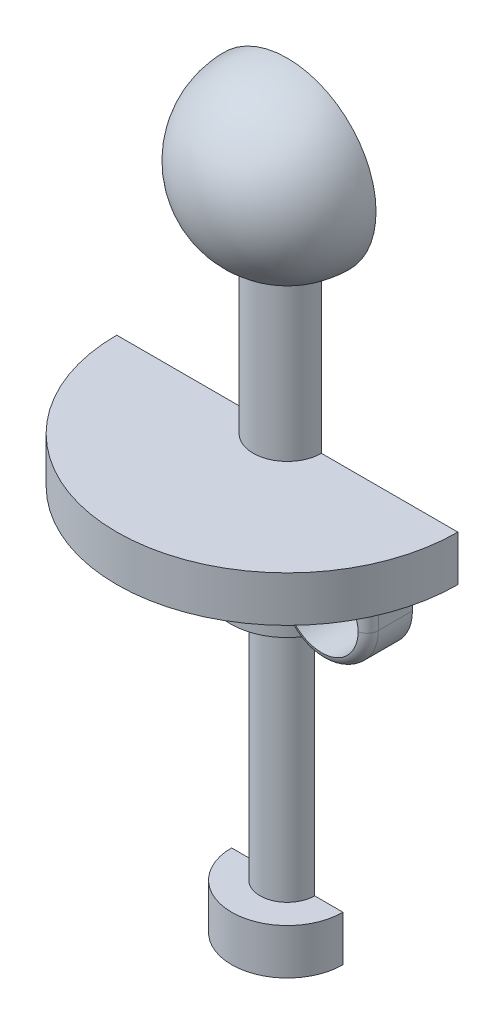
ISO-10303-21;
HEADER;
FILE_DESCRIPTION(('STEP AP214'),'2;1');
FILE_NAME('part.step','',(''),(''),'','','');
FILE_SCHEMA(('AUTOMOTIVE_DESIGN { 1 0 10303 214 1 1 1 1 }'));
ENDSEC;
DATA;
#1=APPLICATION_CONTEXT('core data for automotive mechanical design processes');
#2=APPLICATION_PROTOCOL_DEFINITION('international standard','automotive_design',2000,#1);
#3=PRODUCT_CONTEXT('',#1,'mechanical');
#4=PRODUCT('Part','Part','',(#3));
#5=PRODUCT_RELATED_PRODUCT_CATEGORY('part','',(#4));
#6=PRODUCT_DEFINITION_FORMATION('','',#4);
#7=PRODUCT_DEFINITION_CONTEXT('part definition',#1,'design');
#8=PRODUCT_DEFINITION('design','',#6,#7);
#9=PRODUCT_DEFINITION_SHAPE('','',#8);
#10=(LENGTH_UNIT() NAMED_UNIT(*) SI_UNIT(.MILLI.,.METRE.));
#11=(NAMED_UNIT(*) PLANE_ANGLE_UNIT() SI_UNIT($,.RADIAN.));
#12=(NAMED_UNIT(*) SI_UNIT($,.STERADIAN.) SOLID_ANGLE_UNIT());
#13=UNCERTAINTY_MEASURE_WITH_UNIT(LENGTH_MEASURE(1.E-05),#10,'distance_accuracy_value','');
#14=(GEOMETRIC_REPRESENTATION_CONTEXT(3) GLOBAL_UNCERTAINTY_ASSIGNED_CONTEXT((#13)) GLOBAL_UNIT_ASSIGNED_CONTEXT((#10,
#11,#12)) REPRESENTATION_CONTEXT('',''));
#15=CARTESIAN_POINT('',(0.,0.,0.));
#16=DIRECTION('',(0.,0.,1.));
#17=DIRECTION('',(1.,0.,0.));
#18=AXIS2_PLACEMENT_3D('',#15,#16,#17);
#19=CARTESIAN_POINT('',(0.,0.,0.));
#20=DIRECTION('',(0.,0.,1.));
#21=DIRECTION('',(1.,0.,0.));
#22=AXIS2_PLACEMENT_3D('',#19,#20,#21);
#23=PLANE('',#22);
#24=CARTESIAN_POINT('',(3.5,-4.,0.));
#25=DIRECTION('',(0.,0.,-1.));
#26=DIRECTION('',(-1.,0.,0.));
#27=AXIS2_PLACEMENT_3D('',#24,#25,#26);
#28=CIRCLE('',#27,1.6);
#29=CARTESIAN_POINT('',(1.9,-4.,0.));
#30=VERTEX_POINT('',#29);
#31=EDGE_CURVE('E266',#30,#30,#28,.T.);
#32=ORIENTED_EDGE('',*,*,#31,.F.);
#33=EDGE_LOOP('',(#32));
#34=FACE_BOUND('',#33,.T.);
#35=CARTESIAN_POINT('',(-3.5,-4.,0.));
#36=DIRECTION('',(0.,0.,1.));
#37=DIRECTION('',(1.,0.,0.));
#38=AXIS2_PLACEMENT_3D('',#35,#36,#37);
#39=CIRCLE('',#38,1.6);
#40=CARTESIAN_POINT('',(-1.9,-4.,0.));
#41=VERTEX_POINT('',#40);
#42=EDGE_CURVE('E11',#41,#41,#39,.T.);
#43=ORIENTED_EDGE('',*,*,#42,.T.);
#44=EDGE_LOOP('',(#43));
#45=FACE_BOUND('',#44,.T.);
#46=CARTESIAN_POINT('',(-3.5,-4.,0.));
#47=DIRECTION('',(0.,0.,1.));
#48=DIRECTION('',(1.,0.,0.));
#49=AXIS2_PLACEMENT_3D('',#46,#47,#48);
#50=CIRCLE('',#49,2.);
#51=CARTESIAN_POINT('',(-5.5,-4.,0.));
#52=VERTEX_POINT('',#51);
#53=CARTESIAN_POINT('',(-2.5,-5.73205080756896,0.));
#54=VERTEX_POINT('',#53);
#55=EDGE_CURVE('E730',#52,#54,#50,.T.);
#56=ORIENTED_EDGE('',*,*,#55,.F.);
#57=DIRECTION('',(0.,1.,0.));
#58=VECTOR('',#57,1.);
#59=CARTESIAN_POINT('',(-5.5,0.,0.));
#60=LINE('',#59,#58);
#61=CARTESIAN_POINT('',(-5.5,-2.,0.));
#62=VERTEX_POINT('',#61);
#63=EDGE_CURVE('E56',#52,#62,#60,.T.);
#64=ORIENTED_EDGE('',*,*,#63,.T.);
#65=DIRECTION('',(1.,0.,0.));
#66=VECTOR('',#65,1.);
#67=CARTESIAN_POINT('',(0.,-2.,0.));
#68=LINE('',#67,#66);
#69=CARTESIAN_POINT('',(-7.5,-2.,0.));
#70=VERTEX_POINT('',#69);
#71=EDGE_CURVE('E64',#70,#62,#68,.T.);
#72=ORIENTED_EDGE('',*,*,#71,.F.);
#73=DIRECTION('',(0.,1.,0.));
#74=VECTOR('',#73,1.);
#75=CARTESIAN_POINT('',(-7.5,-2.,0.));
#76=LINE('',#75,#74);
#77=CARTESIAN_POINT('',(-7.5,0.,0.));
#78=VERTEX_POINT('',#77);
#79=EDGE_CURVE('E687',#70,#78,#76,.T.);
#80=ORIENTED_EDGE('',*,*,#79,.T.);
#81=DIRECTION('',(1.,0.,0.));
#82=VECTOR('',#81,1.);
#83=CARTESIAN_POINT('',(0.,0.,0.));
#84=LINE('',#83,#82);
#85=CARTESIAN_POINT('',(-1.5,0.,0.));
#86=VERTEX_POINT('',#85);
#87=EDGE_CURVE('E685',#78,#86,#84,.T.);
#88=ORIENTED_EDGE('',*,*,#87,.T.);
#89=DIRECTION('',(0.,-1.,0.));
#90=VECTOR('',#89,1.);
#91=CARTESIAN_POINT('',(-1.5,0.,0.));
#92=LINE('',#91,#90);
#93=CARTESIAN_POINT('',(-1.5,6.8,0.));
#94=VERTEX_POINT('',#93);
#95=EDGE_CURVE('E699',#86,#94,#92,.F.);
#96=ORIENTED_EDGE('',*,*,#95,.T.);
#97=CARTESIAN_POINT('',(0.,10.4,0.));
#98=DIRECTION('',(0.,0.,1.));
#99=DIRECTION('',(1.,0.,0.));
#100=AXIS2_PLACEMENT_3D('',#97,#98,#99);
#101=CIRCLE('',#100,3.9);
#102=CARTESIAN_POINT('',(1.5,6.8,0.));
#103=VERTEX_POINT('',#102);
#104=EDGE_CURVE('E710',#103,#94,#101,.T.);
#105=ORIENTED_EDGE('',*,*,#104,.F.);
#106=DIRECTION('',(0.,-1.,0.));
#107=VECTOR('',#106,1.);
#108=CARTESIAN_POINT('',(1.5,0.,0.));
#109=LINE('',#108,#107);
#110=CARTESIAN_POINT('',(1.5,0.,0.));
#111=VERTEX_POINT('',#110);
#112=EDGE_CURVE('E696',#103,#111,#109,.T.);
#113=ORIENTED_EDGE('',*,*,#112,.T.);
#114=CARTESIAN_POINT('',(7.5,0.,0.));
#115=VERTEX_POINT('',#114);
#116=EDGE_CURVE('E682',#111,#115,#84,.T.);
#117=ORIENTED_EDGE('',*,*,#116,.T.);
#118=DIRECTION('',(0.,1.,0.));
#119=VECTOR('',#118,1.);
#120=CARTESIAN_POINT('',(7.5,-2.,0.));
#121=LINE('',#120,#119);
#122=CARTESIAN_POINT('',(7.5,-2.,0.));
#123=VERTEX_POINT('',#122);
#124=EDGE_CURVE('E689',#115,#123,#121,.F.);
#125=ORIENTED_EDGE('',*,*,#124,.T.);
#126=CARTESIAN_POINT('',(5.5,-2.,0.));
#127=VERTEX_POINT('',#126);
#128=EDGE_CURVE('E766',#127,#123,#68,.T.);
#129=ORIENTED_EDGE('',*,*,#128,.F.);
#130=DIRECTION('',(0.,1.,0.));
#131=VECTOR('',#130,1.);
#132=CARTESIAN_POINT('',(5.5,0.,0.));
#133=LINE('',#132,#131);
#134=CARTESIAN_POINT('',(5.5,-4.,0.));
#135=VERTEX_POINT('',#134);
#136=EDGE_CURVE('E349',#135,#127,#133,.T.);
#137=ORIENTED_EDGE('',*,*,#136,.F.);
#138=CARTESIAN_POINT('',(3.5,-4.,0.));
#139=DIRECTION('',(0.,0.,1.));
#140=DIRECTION('',(1.,0.,0.));
#141=AXIS2_PLACEMENT_3D('',#138,#139,#140);
#142=CIRCLE('',#141,2.);
#143=CARTESIAN_POINT('',(2.5,-5.73205080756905,0.));
#144=VERTEX_POINT('',#143);
#145=EDGE_CURVE('E693',#135,#144,#142,.F.);
#146=ORIENTED_EDGE('',*,*,#145,.T.);
#147=DIRECTION('',(0.,1.,0.));
#148=VECTOR('',#147,1.);
#149=CARTESIAN_POINT('',(2.5,-2.,0.));
#150=LINE('',#149,#148);
#151=CARTESIAN_POINT('',(2.5,-6.,0.));
#152=VERTEX_POINT('',#151);
#153=EDGE_CURVE('E734',#152,#144,#150,.T.);
#154=ORIENTED_EDGE('',*,*,#153,.F.);
#155=DIRECTION('',(1.,0.,0.));
#156=VECTOR('',#155,1.);
#157=CARTESIAN_POINT('',(0.,-6.,0.));
#158=LINE('',#157,#156);
#159=CARTESIAN_POINT('',(1.2,-6.,0.));
#160=VERTEX_POINT('',#159);
#161=EDGE_CURVE('E657',#160,#152,#158,.T.);
#162=ORIENTED_EDGE('',*,*,#161,.F.);
#163=DIRECTION('',(0.,1.,0.));
#164=VECTOR('',#163,1.);
#165=CARTESIAN_POINT('',(1.2,-2.,0.));
#166=LINE('',#165,#164);
#167=CARTESIAN_POINT('',(1.2,-17.,0.));
#168=VERTEX_POINT('',#167);
#169=EDGE_CURVE('E714',#168,#160,#166,.T.);
#170=ORIENTED_EDGE('',*,*,#169,.F.);
#171=DIRECTION('',(-1.,0.,0.));
#172=VECTOR('',#171,1.);
#173=CARTESIAN_POINT('',(0.,-17.,0.));
#174=LINE('',#173,#172);
#175=CARTESIAN_POINT('',(2.45,-17.,0.));
#176=VERTEX_POINT('',#175);
#177=EDGE_CURVE('E718',#176,#168,#174,.T.);
#178=ORIENTED_EDGE('',*,*,#177,.F.);
#179=DIRECTION('',(0.,1.,0.));
#180=VECTOR('',#179,1.);
#181=CARTESIAN_POINT('',(2.45,-2.,0.));
#182=LINE('',#181,#180);
#183=CARTESIAN_POINT('',(2.45,-19.,0.));
#184=VERTEX_POINT('',#183);
#185=EDGE_CURVE('E726',#184,#176,#182,.T.);
#186=ORIENTED_EDGE('',*,*,#185,.F.);
#187=DIRECTION('',(1.,0.,0.));
#188=VECTOR('',#187,1.);
#189=CARTESIAN_POINT('',(0.,-19.,0.));
#190=LINE('',#189,#188);
#191=CARTESIAN_POINT('',(-2.45,-19.,0.));
#192=VERTEX_POINT('',#191);
#193=EDGE_CURVE('E713',#192,#184,#190,.T.);
#194=ORIENTED_EDGE('',*,*,#193,.F.);
#195=DIRECTION('',(0.,1.,0.));
#196=VECTOR('',#195,1.);
#197=CARTESIAN_POINT('',(-2.45,-2.,0.));
#198=LINE('',#197,#196);
#199=CARTESIAN_POINT('',(-2.45,-17.,0.));
#200=VERTEX_POINT('',#199);
#201=EDGE_CURVE('E729',#200,#192,#198,.F.);
#202=ORIENTED_EDGE('',*,*,#201,.F.);
#203=CARTESIAN_POINT('',(-1.2,-17.,0.));
#204=VERTEX_POINT('',#203);
#205=EDGE_CURVE('E721',#204,#200,#174,.T.);
#206=ORIENTED_EDGE('',*,*,#205,.F.);
#207=DIRECTION('',(0.,1.,0.));
#208=VECTOR('',#207,1.);
#209=CARTESIAN_POINT('',(-1.2,-2.,0.));
#210=LINE('',#209,#208);
#211=CARTESIAN_POINT('',(-1.2,-6.,0.));
#212=VERTEX_POINT('',#211);
#213=EDGE_CURVE('E716',#212,#204,#210,.F.);
#214=ORIENTED_EDGE('',*,*,#213,.F.);
#215=CARTESIAN_POINT('',(-2.5,-6.,0.));
#216=VERTEX_POINT('',#215);
#217=EDGE_CURVE('E654',#216,#212,#158,.T.);
#218=ORIENTED_EDGE('',*,*,#217,.F.);
#219=DIRECTION('',(0.,1.,0.));
#220=VECTOR('',#219,1.);
#221=CARTESIAN_POINT('',(-2.5,-2.,0.));
#222=LINE('',#221,#220);
#223=EDGE_CURVE('E50',#54,#216,#222,.F.);
#224=ORIENTED_EDGE('',*,*,#223,.F.);
#225=EDGE_LOOP('',(#56,#64,#72,#80,#88,#96,#105,#113,#117,#125,#129,#137,#146,#154,#162,#170,
#178,#186,#194,#202,#206,#214,#218,#224));
#226=FACE_BOUND('',#225,.T.);
#227=ADVANCED_FACE('F47',(#34,#45,#226),#23,.F.);
#228=CARTESIAN_POINT('',(0.,-2.,0.));
#229=DIRECTION('',(0.,1.,0.));
#230=DIRECTION('',(-1.,0.,0.));
#231=AXIS2_PLACEMENT_3D('',#228,#229,#230);
#232=CYLINDRICAL_SURFACE('',#231,2.);
#233=DIRECTION('',(0.,1.,0.));
#234=VECTOR('',#233,1.);
#235=CARTESIAN_POINT('',(1.5,-2.,1.3228756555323));
#236=LINE('',#235,#234);
#237=CARTESIAN_POINT('',(1.5,-3.42857142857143,1.3228756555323));
#238=VERTEX_POINT('',#237);
#239=CARTESIAN_POINT('',(1.5,-4.,1.3228756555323));
#240=VERTEX_POINT('',#239);
#241=EDGE_CURVE('E474',#238,#240,#236,.F.);
#242=ORIENTED_EDGE('',*,*,#241,.F.);
#243=CARTESIAN_POINT('',(0.,-3.42857142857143,0.));
#244=DIRECTION('',(0.,1.,0.));
#245=DIRECTION('',(-1.,0.,0.));
#246=AXIS2_PLACEMENT_3D('',#243,#244,#245);
#247=CIRCLE('',#246,2.);
#248=CARTESIAN_POINT('',(-1.5,-3.42857142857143,1.3228756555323));
#249=VERTEX_POINT('',#248);
#250=EDGE_CURVE('E521',#249,#238,#247,.T.);
#251=ORIENTED_EDGE('',*,*,#250,.F.);
#252=DIRECTION('',(0.,1.,0.));
#253=VECTOR('',#252,1.);
#254=CARTESIAN_POINT('',(-1.5,-2.,1.3228756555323));
#255=LINE('',#254,#253);
#256=CARTESIAN_POINT('',(-1.5,-4.,1.3228756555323));
#257=VERTEX_POINT('',#256);
#258=EDGE_CURVE('E583',#249,#257,#255,.F.);
#259=ORIENTED_EDGE('',*,*,#258,.T.);
#260=CARTESIAN_POINT('',(-1.58337030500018,-3.42857142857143,1.22185861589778));
#261=CARTESIAN_POINT('',(-1.57352992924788,-3.46155005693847,1.23460073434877));
#262=CARTESIAN_POINT('',(-1.56442479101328,-3.49522502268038,1.24609103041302));
#263=CARTESIAN_POINT('',(-1.54785426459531,-3.56369800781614,1.266620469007));
#264=CARTESIAN_POINT('',(-1.54038848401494,-3.59849575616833,1.27566019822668));
#265=CARTESIAN_POINT('',(-1.52726032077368,-3.6689647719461,1.29134794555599));
#266=CARTESIAN_POINT('',(-1.5215981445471,-3.70463613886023,1.29799568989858));
#267=CARTESIAN_POINT('',(-1.51218696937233,-3.77657731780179,1.30894655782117));
#268=CARTESIAN_POINT('',(-1.50843801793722,-3.8128471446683,1.31324962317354));
#269=CARTESIAN_POINT('',(-1.50018567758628,-3.92214475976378,1.32269730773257));
#270=CARTESIAN_POINT('',(-1.49866098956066,-3.99574449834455,1.32439862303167));
#271=CARTESIAN_POINT('',(-1.50371838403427,-4.14220236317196,1.31865228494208));
#272=CARTESIAN_POINT('',(-1.51028901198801,-4.21506139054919,1.31121755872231));
#273=CARTESIAN_POINT('',(-1.52591116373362,-4.32301588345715,1.29292525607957));
#274=CARTESIAN_POINT('',(-1.53217539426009,-4.35914447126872,1.28552280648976));
#275=CARTESIAN_POINT('',(-1.54651810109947,-4.43038405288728,1.26822862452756));
#276=CARTESIAN_POINT('',(-1.55459437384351,-4.46549622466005,1.25833991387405));
#277=CARTESIAN_POINT('',(-1.56350832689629,-4.5,1.24717348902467));
#278=B_SPLINE_CURVE_WITH_KNOTS('',3,(#260,#261,#262,#263,#264,#265,#266,#267,#268,#269,#270,
#271,#272,#273,#274,#275,#276,#277),.UNSPECIFIED.,.F.,.F.,(4,2,2,2,2,2,2,2,4),(0.,
0.110051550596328,0.220076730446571,0.3301144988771,0.440154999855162,0.659977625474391,
0.879489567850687,0.991587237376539,1.10354932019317),.UNSPECIFIED.);
#279=CARTESIAN_POINT('',(-1.56350832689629,-4.5,1.24717348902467));
#280=VERTEX_POINT('',#279);
#281=EDGE_CURVE('E428',#257,#280,#278,.T.);
#282=ORIENTED_EDGE('',*,*,#281,.T.);
#283=CARTESIAN_POINT('',(0.,-4.5,0.));
#284=DIRECTION('',(0.,1.,0.));
#285=DIRECTION('',(-1.,0.,0.));
#286=AXIS2_PLACEMENT_3D('',#283,#284,#285);
#287=CIRCLE('',#286,2.);
#288=CARTESIAN_POINT('',(1.56350832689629,-4.5,1.24717348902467));
#289=VERTEX_POINT('',#288);
#290=EDGE_CURVE('E664',#280,#289,#287,.T.);
#291=ORIENTED_EDGE('',*,*,#290,.T.);
#292=CARTESIAN_POINT('',(1.5,-4.,1.3228756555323));
#293=CARTESIAN_POINT('',(1.50000394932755,-4.07187722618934,1.32287639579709));
#294=CARTESIAN_POINT('',(1.50390279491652,-4.14382046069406,1.31849077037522));
#295=CARTESIAN_POINT('',(1.51924289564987,-4.28586527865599,1.30078205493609));
#296=CARTESIAN_POINT('',(1.53069575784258,-4.35596385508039,1.28744521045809));
#297=CARTESIAN_POINT('',(1.56029280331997,-4.49234597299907,1.25141077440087));
#298=CARTESIAN_POINT('',(1.57844418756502,-4.5586253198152,1.22870310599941));
#299=CARTESIAN_POINT('',(1.6198682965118,-4.68522838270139,1.17354527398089));
#300=CARTESIAN_POINT('',(1.64313735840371,-4.74555631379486,1.14110207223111));
#301=CARTESIAN_POINT('',(1.69208646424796,-4.85738372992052,1.06712869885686));
#302=CARTESIAN_POINT('',(1.71771137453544,-4.90903100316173,1.0257857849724));
#303=CARTESIAN_POINT('',(1.76918479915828,-5.00358539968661,0.934202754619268));
#304=CARTESIAN_POINT('',(1.79503329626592,-5.04649319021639,0.883963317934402));
#305=CARTESIAN_POINT('',(1.84354302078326,-5.12164714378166,0.777592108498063));
#306=CARTESIAN_POINT('',(1.86628157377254,-5.15419997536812,0.721711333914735));
#307=CARTESIAN_POINT('',(1.90755084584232,-5.21050777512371,0.604255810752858));
#308=CARTESIAN_POINT('',(1.92608070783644,-5.23426095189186,0.542679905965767));
#309=CARTESIAN_POINT('',(1.95784484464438,-5.27374236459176,0.413941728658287));
#310=CARTESIAN_POINT('',(1.97093572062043,-5.28925597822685,0.346678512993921));
#311=CARTESIAN_POINT('',(1.99017119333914,-5.31173014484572,0.209767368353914));
#312=CARTESIAN_POINT('',(1.99631374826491,-5.31868818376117,0.140118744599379));
#313=CARTESIAN_POINT('',(2.00133839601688,-5.32439858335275,-0.00305025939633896));
#314=CARTESIAN_POINT('',(1.99986756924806,-5.32275204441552,-0.0765993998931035));
#315=CARTESIAN_POINT('',(1.98894743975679,-5.31026237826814,-0.222323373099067));
#316=CARTESIAN_POINT('',(1.97949720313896,-5.29941817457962,-0.294498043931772));
#317=CARTESIAN_POINT('',(1.9532139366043,-5.26802005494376,-0.436106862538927));
#318=CARTESIAN_POINT('',(1.9363082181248,-5.24737038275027,-0.505506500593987));
#319=CARTESIAN_POINT('',(1.89658292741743,-5.19586957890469,-0.638585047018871));
#320=CARTESIAN_POINT('',(1.87376597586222,-5.16502296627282,-0.702266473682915));
#321=CARTESIAN_POINT('',(1.82543454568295,-5.09434119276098,-0.81954866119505));
#322=CARTESIAN_POINT('',(1.80005913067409,-5.05490135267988,-0.873444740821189));
#323=CARTESIAN_POINT('',(1.74847049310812,-4.96681876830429,-0.972615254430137));
#324=CARTESIAN_POINT('',(1.72225749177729,-4.9181784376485,-1.01789194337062));
#325=CARTESIAN_POINT('',(1.67264648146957,-4.81482127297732,-1.09744010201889));
#326=CARTESIAN_POINT('',(1.64917880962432,-4.76041221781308,-1.13206948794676));
#327=CARTESIAN_POINT('',(1.60604281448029,-4.64551627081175,-1.19248039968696));
#328=CARTESIAN_POINT('',(1.58637525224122,-4.58502816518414,-1.21826015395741));
#329=CARTESIAN_POINT('',(1.55213937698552,-4.45849096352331,-1.26160402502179));
#330=CARTESIAN_POINT('',(1.53767209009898,-4.39235971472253,-1.27900739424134));
#331=CARTESIAN_POINT('',(1.51544237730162,-4.25732836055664,-1.30527046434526));
#332=CARTESIAN_POINT('',(1.50768188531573,-4.18842746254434,-1.3141277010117));
#333=CARTESIAN_POINT('',(1.49921027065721,-4.04630755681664,-1.32378813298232));
#334=CARTESIAN_POINT('',(1.49885362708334,-3.97303950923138,-1.32418635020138));
#335=CARTESIAN_POINT('',(1.50612721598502,-3.8274061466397,-1.31590647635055));
#336=CARTESIAN_POINT('',(1.51375876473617,-3.75504098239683,-1.30722688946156));
#337=CARTESIAN_POINT('',(1.53661882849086,-3.61212095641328,-1.28028090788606));
#338=CARTESIAN_POINT('',(1.55196576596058,-3.54161292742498,-1.26186483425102));
#339=CARTESIAN_POINT('',(1.58900037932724,-3.40583887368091,-1.21489346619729));
#340=CARTESIAN_POINT('',(1.6106855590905,-3.34057079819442,-1.18634216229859));
#341=CARTESIAN_POINT('',(1.65747407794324,-3.21950823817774,-1.11998289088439));
#342=CARTESIAN_POINT('',(1.68243324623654,-3.16346416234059,-1.08252925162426));
#343=CARTESIAN_POINT('',(1.73381436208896,-3.05982010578,-0.998156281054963));
#344=CARTESIAN_POINT('',(1.76023582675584,-3.01221735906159,-0.951240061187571));
#345=CARTESIAN_POINT('',(1.81071399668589,-2.92826363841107,-0.851070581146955));
#346=CARTESIAN_POINT('',(1.83482348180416,-2.89152036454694,-0.79817150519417));
#347=CARTESIAN_POINT('',(1.87967488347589,-2.82692774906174,-0.685911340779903));
#348=CARTESIAN_POINT('',(1.90041621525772,-2.79907995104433,-0.626549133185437));
#349=CARTESIAN_POINT('',(1.93699242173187,-2.7518353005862,-0.502297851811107));
#350=CARTESIAN_POINT('',(1.95276739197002,-2.73254056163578,-0.437352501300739));
#351=CARTESIAN_POINT('',(1.97787270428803,-2.70249749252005,-0.304313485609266));
#352=CARTESIAN_POINT('',(1.98720121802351,-2.69175158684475,-0.236218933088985));
#353=CARTESIAN_POINT('',(1.99903515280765,-2.67818581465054,-0.0953384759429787));
#354=CARTESIAN_POINT('',(2.00119232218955,-2.67577028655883,-0.0224840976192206));
#355=CARTESIAN_POINT('',(1.99755002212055,-2.67990513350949,0.122781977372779));
#356=CARTESIAN_POINT('',(1.99174893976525,-2.6864573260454,0.195193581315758));
#357=CARTESIAN_POINT('',(1.97240570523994,-2.70899989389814,0.339109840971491));
#358=CARTESIAN_POINT('',(1.95870017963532,-2.72518969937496,0.410561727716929));
#359=CARTESIAN_POINT('',(1.92456961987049,-2.76762206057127,0.548716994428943));
#360=CARTESIAN_POINT('',(1.90414674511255,-2.79386138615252,0.615421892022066));
#361=CARTESIAN_POINT('',(1.85918737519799,-2.85582037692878,0.740055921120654));
#362=CARTESIAN_POINT('',(1.83479138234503,-2.89123468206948,0.798187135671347));
#363=CARTESIAN_POINT('',(1.78390918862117,-2.97175474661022,0.906220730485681));
#364=CARTESIAN_POINT('',(1.75742395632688,-3.01685603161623,0.956126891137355));
#365=CARTESIAN_POINT('',(1.70631449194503,-3.11368918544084,1.04450316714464));
#366=CARTESIAN_POINT('',(1.68166041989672,-3.16502590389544,1.0833903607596));
#367=CARTESIAN_POINT('',(1.63525348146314,-3.27456492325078,1.15224873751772));
#368=CARTESIAN_POINT('',(1.61350204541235,-3.33277058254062,1.1822155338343));
#369=CARTESIAN_POINT('',(1.57470232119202,-3.45470552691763,1.23343199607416));
#370=CARTESIAN_POINT('',(1.55767839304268,-3.51846127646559,1.25463677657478));
#371=CARTESIAN_POINT('',(1.52982845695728,-3.64943454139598,1.28845217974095));
#372=CARTESIAN_POINT('',(1.51899483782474,-3.71664769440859,1.30107335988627));
#373=CARTESIAN_POINT('',(1.50776947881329,-3.82026339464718,1.31402447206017));
#374=CARTESIAN_POINT('',(1.50486190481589,-3.85606320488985,1.31734569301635));
#375=CARTESIAN_POINT('',(1.50097617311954,-3.92790313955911,1.32177110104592));
#376=CARTESIAN_POINT('',(1.49999801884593,-3.96394326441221,1.32287528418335));
#377=CARTESIAN_POINT('',(1.5,-4.,1.3228756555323));
#378=B_SPLINE_CURVE_WITH_KNOTS('',3,(#292,#293,#294,#295,#296,#297,#298,#299,#300,#301,#302,
#303,#304,#305,#306,#307,#308,#309,#310,#311,#312,#313,#314,#315,#316,#317,#318,#319,#320,#321,
#322,#323,#324,#325,#326,#327,#328,#329,#330,#331,#332,#333,#334,#335,#336,#337,#338,#339,#340,
#341,#342,#343,#344,#345,#346,#347,#348,#349,#350,#351,#352,#353,#354,#355,#356,#357,#358,#359,
#360,#361,#362,#363,#364,#365,#366,#367,#368,#369,#370,#371,#372,#373,#374,#375,#376,#377),
.UNSPECIFIED.,.T.,.F.,(4,2,2,2,2,2,2,2,2,2,2,2,2,2,2,2,2,2,2,2,2,2,2,2,2,2,2,2,2,2,2,2,2,2,2,2,
2,2,2,2,2,2,4),(0.,0.215506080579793,0.431344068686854,0.647414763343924,0.863331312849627,
1.07508496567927,1.28682244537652,1.49153031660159,1.69627983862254,1.90612927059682,
2.11604035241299,2.33576660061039,2.55551856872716,2.77746211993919,2.99930744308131,
3.21254268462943,3.42572206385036,3.63065638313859,3.83563170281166,4.04439761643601,
4.25322370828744,4.47202599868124,4.69086434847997,4.91316913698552,5.13538649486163,
5.34991775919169,5.56437859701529,5.76972240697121,5.97510183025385,6.1828712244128,
6.39069952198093,6.60848338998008,6.8263114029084,7.04881172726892,7.27124059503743,
7.48705025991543,7.70276045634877,7.90865407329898,8.11464877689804,8.32168603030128,
8.52846817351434,8.63657518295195,8.74468238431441),.UNSPECIFIED.);
#379=EDGE_CURVE('E437',#240,#289,#378,.T.);
#380=ORIENTED_EDGE('',*,*,#379,.F.);
#381=EDGE_LOOP('',(#242,#251,#259,#282,#291,#380));
#382=FACE_BOUND('',#381,.T.);
#383=ADVANCED_FACE('F420',(#382),#232,.T.);
#384=CARTESIAN_POINT('',(-1.5,0.,2.));
#385=DIRECTION('',(-1.,0.,0.));
#386=DIRECTION('',(0.,0.,1.));
#387=AXIS2_PLACEMENT_3D('',#384,#385,#386);
#388=PLANE('',#387);
#389=CARTESIAN_POINT('',(-1.5,-3.78571416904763,-0.0007));
#390=CARTESIAN_POINT('',(-1.5,-3.78572808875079,0.0306676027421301));
#391=CARTESIAN_POINT('',(-1.5,-3.78503186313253,0.0620310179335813));
#392=CARTESIAN_POINT('',(-1.5,-3.7822501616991,0.124689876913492));
#393=CARTESIAN_POINT('',(-1.5,-3.78016497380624,0.15598533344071));
#394=CARTESIAN_POINT('',(-1.5,-3.77188584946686,0.249544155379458));
#395=CARTESIAN_POINT('',(-1.5,-3.76366809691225,0.311636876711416));
#396=CARTESIAN_POINT('',(-1.5,-3.74253342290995,0.434182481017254));
#397=CARTESIAN_POINT('',(-1.5,-3.72967728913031,0.494646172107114));
#398=CARTESIAN_POINT('',(-1.5,-3.69996292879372,0.614599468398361));
#399=CARTESIAN_POINT('',(-1.5,-3.683102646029,0.674088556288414));
#400=CARTESIAN_POINT('',(-1.5,-3.63010667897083,0.84310155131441));
#401=CARTESIAN_POINT('',(-1.5,-3.58992173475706,0.951347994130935));
#402=CARTESIAN_POINT('',(-1.5,-3.50203284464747,1.1648222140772));
#403=CARTESIAN_POINT('',(-1.5,-3.4543172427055,1.27004500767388));
#404=CARTESIAN_POINT('',(-1.5,-3.35261108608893,1.48083639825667));
#405=CARTESIAN_POINT('',(-1.5,-3.29848778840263,1.58634031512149));
#406=CARTESIAN_POINT('',(-1.5,-3.21479313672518,1.7429608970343));
#407=CARTESIAN_POINT('',(-1.5,-3.18653653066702,1.79479162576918));
#408=CARTESIAN_POINT('',(-1.5,-3.1292957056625,1.89803827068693));
#409=CARTESIAN_POINT('',(-1.5,-3.10031161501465,1.94945425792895));
#410=CARTESIAN_POINT('',(-1.5,-3.07102854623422,2.0007));
#411=B_SPLINE_CURVE_WITH_KNOTS('',3,(#389,#390,#391,#392,#393,#394,#395,#396,#397,#398,#399,
#400,#401,#402,#403,#404,#405,#406,#407,#408,#409,#410),.UNSPECIFIED.,.F.,.F.,(4,2,2,2,2,2,2,2,
2,2,4),(0.,0.0940865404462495,0.188153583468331,0.375818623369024,0.561108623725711,
0.74649398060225,1.09240003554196,1.43884683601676,1.79447124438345,1.97156579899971,
2.14862933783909),.UNSPECIFIED.);
#412=CARTESIAN_POINT('',(-1.5,-3.3419140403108,1.50000000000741));
#413=VERTEX_POINT('',#412);
#414=EDGE_CURVE('E546',#249,#413,#411,.T.);
#415=ORIENTED_EDGE('',*,*,#414,.T.);
#416=DIRECTION('',(0.,1.,0.));
#417=VECTOR('',#416,1.);
#418=CARTESIAN_POINT('',(-1.5,-4.,1.5));
#419=LINE('',#418,#417);
#420=CARTESIAN_POINT('',(-1.5,-4.,1.5));
#421=VERTEX_POINT('',#420);
#422=EDGE_CURVE('E297',#413,#421,#419,.F.);
#423=ORIENTED_EDGE('',*,*,#422,.T.);
#424=DIRECTION('',(0.,0.,-1.));
#425=VECTOR('',#424,1.);
#426=CARTESIAN_POINT('',(-1.5,-4.,2.));
#427=LINE('',#426,#425);
#428=EDGE_CURVE('E526',#421,#257,#427,.T.);
#429=ORIENTED_EDGE('',*,*,#428,.T.);
#430=ORIENTED_EDGE('',*,*,#258,.F.);
#431=EDGE_LOOP('',(#415,#423,#429,#430));
#432=FACE_BOUND('',#431,.T.);
#433=ADVANCED_FACE('F424',(#432),#388,.F.);
#434=CARTESIAN_POINT('',(-3.5,-4.,2.));
#435=DIRECTION('',(0.,0.,-1.));
#436=DIRECTION('',(-1.,0.,0.));
#437=AXIS2_PLACEMENT_3D('',#434,#435,#436);
#438=CYLINDRICAL_SURFACE('',#437,2.);
#439=ORIENTED_EDGE('',*,*,#428,.F.);
#440=CARTESIAN_POINT('',(-3.5,-4.,1.5));
#441=DIRECTION('',(0.,0.,1.));
#442=DIRECTION('',(1.,0.,0.));
#443=AXIS2_PLACEMENT_3D('',#440,#441,#442);
#444=CIRCLE('',#443,2.);
#445=CARTESIAN_POINT('',(-1.56350832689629,-4.5,1.5));
#446=VERTEX_POINT('',#445);
#447=EDGE_CURVE('E287',#421,#446,#444,.F.);
#448=ORIENTED_EDGE('',*,*,#447,.T.);
#449=DIRECTION('',(0.,0.,-1.));
#450=VECTOR('',#449,1.);
#451=CARTESIAN_POINT('',(-1.56350832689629,-4.5,2.));
#452=LINE('',#451,#450);
#453=EDGE_CURVE('E539',#446,#280,#452,.T.);
#454=ORIENTED_EDGE('',*,*,#453,.T.);
#455=ORIENTED_EDGE('',*,*,#281,.F.);
#456=EDGE_LOOP('',(#439,#448,#454,#455));
#457=FACE_BOUND('',#456,.T.);
#458=ADVANCED_FACE('F459',(#457),#438,.T.);
#459=CARTESIAN_POINT('',(3.5,-4.,2.));
#460=DIRECTION('',(0.,0.,-1.));
#461=DIRECTION('',(-1.,0.,0.));
#462=AXIS2_PLACEMENT_3D('',#459,#460,#461);
#463=CYLINDRICAL_SURFACE('',#462,2.);
#464=DIRECTION('',(0.,0.,-1.));
#465=VECTOR('',#464,1.);
#466=CARTESIAN_POINT('',(1.56350832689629,-4.5,2.));
#467=LINE('',#466,#465);
#468=CARTESIAN_POINT('',(1.56350832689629,-4.5,1.5));
#469=VERTEX_POINT('',#468);
#470=EDGE_CURVE('E447',#469,#289,#467,.T.);
#471=ORIENTED_EDGE('',*,*,#470,.F.);
#472=CARTESIAN_POINT('',(3.5,-4.,1.5));
#473=DIRECTION('',(0.,0.,1.));
#474=DIRECTION('',(1.,0.,0.));
#475=AXIS2_PLACEMENT_3D('',#472,#473,#474);
#476=CIRCLE('',#475,2.);
#477=CARTESIAN_POINT('',(1.5,-4.,1.5));
#478=VERTEX_POINT('',#477);
#479=EDGE_CURVE('E480',#469,#478,#476,.F.);
#480=ORIENTED_EDGE('',*,*,#479,.T.);
#481=DIRECTION('',(0.,0.,-1.));
#482=VECTOR('',#481,1.);
#483=CARTESIAN_POINT('',(1.5,-4.,2.));
#484=LINE('',#483,#482);
#485=EDGE_CURVE('E517',#478,#240,#484,.T.);
#486=ORIENTED_EDGE('',*,*,#485,.T.);
#487=ORIENTED_EDGE('',*,*,#379,.T.);
#488=EDGE_LOOP('',(#471,#480,#486,#487));
#489=FACE_BOUND('',#488,.T.);
#490=ADVANCED_FACE('F455',(#489),#463,.T.);
#491=CARTESIAN_POINT('',(1.5,0.,2.));
#492=DIRECTION('',(-1.,0.,0.));
#493=DIRECTION('',(0.,0.,1.));
#494=AXIS2_PLACEMENT_3D('',#491,#492,#493);
#495=PLANE('',#494);
#496=ORIENTED_EDGE('',*,*,#485,.F.);
#497=DIRECTION('',(0.,1.,0.));
#498=VECTOR('',#497,1.);
#499=CARTESIAN_POINT('',(1.5,0.,1.5));
#500=LINE('',#499,#498);
#501=CARTESIAN_POINT('',(1.5,-3.34191404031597,1.49999999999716));
#502=VERTEX_POINT('',#501);
#503=EDGE_CURVE('E273',#478,#502,#500,.T.);
#504=ORIENTED_EDGE('',*,*,#503,.T.);
#505=CARTESIAN_POINT('',(1.5,-3.78571416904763,-0.0007));
#506=CARTESIAN_POINT('',(1.5,-3.78572808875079,0.0306676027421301));
#507=CARTESIAN_POINT('',(1.5,-3.78503186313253,0.0620310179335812));
#508=CARTESIAN_POINT('',(1.5,-3.7822501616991,0.124689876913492));
#509=CARTESIAN_POINT('',(1.5,-3.78016497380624,0.15598533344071));
#510=CARTESIAN_POINT('',(1.5,-3.77188584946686,0.249544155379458));
#511=CARTESIAN_POINT('',(1.5,-3.76366809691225,0.311636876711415));
#512=CARTESIAN_POINT('',(1.5,-3.74253342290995,0.434182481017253));
#513=CARTESIAN_POINT('',(1.5,-3.72967728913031,0.494646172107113));
#514=CARTESIAN_POINT('',(1.5,-3.69996292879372,0.614599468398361));
#515=CARTESIAN_POINT('',(1.5,-3.683102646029,0.674088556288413));
#516=CARTESIAN_POINT('',(1.5,-3.63010667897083,0.843101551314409));
#517=CARTESIAN_POINT('',(1.5,-3.58992173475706,0.951347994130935));
#518=CARTESIAN_POINT('',(1.5,-3.50203284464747,1.1648222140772));
#519=CARTESIAN_POINT('',(1.5,-3.4543172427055,1.27004500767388));
#520=CARTESIAN_POINT('',(1.5,-3.35261108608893,1.48083639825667));
#521=CARTESIAN_POINT('',(1.5,-3.29848778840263,1.58634031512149));
#522=CARTESIAN_POINT('',(1.5,-3.21479313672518,1.7429608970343));
#523=CARTESIAN_POINT('',(1.5,-3.18653653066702,1.79479162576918));
#524=CARTESIAN_POINT('',(1.5,-3.1292957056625,1.89803827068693));
#525=CARTESIAN_POINT('',(1.5,-3.10031161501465,1.94945425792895));
#526=CARTESIAN_POINT('',(1.5,-3.07102854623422,2.0007));
#527=B_SPLINE_CURVE_WITH_KNOTS('',3,(#505,#506,#507,#508,#509,#510,#511,#512,#513,#514,#515,
#516,#517,#518,#519,#520,#521,#522,#523,#524,#525,#526),.UNSPECIFIED.,.F.,.F.,(4,2,2,2,2,2,2,2,
2,2,4),(0.,0.0940865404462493,0.188153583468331,0.375818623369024,0.56110862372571,
0.74649398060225,1.09240003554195,1.43884683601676,1.79447124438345,1.97156579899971,
2.14862933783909),.UNSPECIFIED.);
#528=EDGE_CURVE('E446',#238,#502,#527,.T.);
#529=ORIENTED_EDGE('',*,*,#528,.F.);
#530=ORIENTED_EDGE('',*,*,#241,.T.);
#531=EDGE_LOOP('',(#496,#504,#529,#530));
#532=FACE_BOUND('',#531,.T.);
#533=ADVANCED_FACE('F415',(#532),#495,.T.);
#534=CARTESIAN_POINT('',(0.,-4.5,0.));
#535=DIRECTION('',(0.,-1.,0.));
#536=DIRECTION('',(1.,0.,0.));
#537=AXIS2_PLACEMENT_3D('',#534,#535,#536);
#538=PLANE('',#537);
#539=CARTESIAN_POINT('',(0.,-4.5,0.));
#540=DIRECTION('',(0.,1.,0.));
#541=DIRECTION('',(-1.,0.,0.));
#542=AXIS2_PLACEMENT_3D('',#539,#540,#541);
#543=CIRCLE('',#542,2.5);
#544=CARTESIAN_POINT('',(-1.69733046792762,-4.5,1.83550246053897));
#545=VERTEX_POINT('',#544);
#546=CARTESIAN_POINT('',(1.69733046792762,-4.5,1.83550246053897));
#547=VERTEX_POINT('',#546);
#548=EDGE_CURVE('E501',#545,#547,#543,.T.);
#549=ORIENTED_EDGE('',*,*,#548,.T.);
#550=CARTESIAN_POINT('',(1.69733046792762,-4.5,1.83550246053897));
#551=CARTESIAN_POINT('',(1.67834877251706,-4.5,1.81533141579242));
#552=CARTESIAN_POINT('',(1.66106835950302,-4.5,1.7935551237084));
#553=CARTESIAN_POINT('',(1.63033299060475,-4.5,1.74739438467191));
#554=CARTESIAN_POINT('',(1.61688516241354,-4.5,1.72300519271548));
#555=CARTESIAN_POINT('',(1.59429690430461,-4.5,1.67226783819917));
#556=CARTESIAN_POINT('',(1.58516201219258,-4.5,1.64591720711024));
#557=CARTESIAN_POINT('',(1.57154459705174,-4.5,1.59210484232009));
#558=CARTESIAN_POINT('',(1.56704922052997,-4.5,1.5646463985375));
#559=CARTESIAN_POINT('',(1.56397917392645,-4.5,1.52470542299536));
#560=CARTESIAN_POINT('',(1.56350440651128,-4.5,1.51234922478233));
#561=CARTESIAN_POINT('',(1.56350832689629,-4.5,1.5));
#562=B_SPLINE_CURVE_WITH_KNOTS('',3,(#550,#551,#552,#553,#554,#555,#556,#557,#558,#559,#560,
#561),.UNSPECIFIED.,.F.,.F.,(4,2,2,2,2,4),(0.,0.0830060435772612,0.166165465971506,
0.249431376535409,0.332465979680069,0.369523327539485),.UNSPECIFIED.);
#563=EDGE_CURVE('E393',#547,#469,#562,.T.);
#564=ORIENTED_EDGE('',*,*,#563,.T.);
#565=ORIENTED_EDGE('',*,*,#470,.T.);
#566=ORIENTED_EDGE('',*,*,#290,.F.);
#567=ORIENTED_EDGE('',*,*,#453,.F.);
#568=CARTESIAN_POINT('',(-1.56350832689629,-4.5,1.5));
#569=CARTESIAN_POINT('',(-1.56348097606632,-4.5,1.52740863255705));
#570=CARTESIAN_POINT('',(-1.56583386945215,-4.5,1.55480694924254));
#571=CARTESIAN_POINT('',(-1.57510517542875,-4.5,1.60882641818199));
#572=CARTESIAN_POINT('',(-1.5820243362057,-4.5,1.63544744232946));
#573=CARTESIAN_POINT('',(-1.60023680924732,-4.5,1.68715687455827));
#574=CARTESIAN_POINT('',(-1.6115319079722,-4.5,1.71224465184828));
#575=CARTESIAN_POINT('',(-1.63811234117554,-4.5,1.76014950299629));
#576=CARTESIAN_POINT('',(-1.65338963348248,-4.5,1.78297102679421));
#577=CARTESIAN_POINT('',(-1.6789564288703,-4.5,1.81512228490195));
#578=CARTESIAN_POINT('',(-1.68793963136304,-4.5,1.82550984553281));
#579=CARTESIAN_POINT('',(-1.69733046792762,-4.5,1.83550246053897));
#580=B_SPLINE_CURVE_WITH_KNOTS('',3,(#568,#569,#570,#571,#572,#573,#574,#575,#576,#577,#578,
#579),.UNSPECIFIED.,.F.,.F.,(4,2,2,2,2,4),(0.,0.0821100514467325,0.164233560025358,
0.246390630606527,0.328383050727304,0.369532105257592),.UNSPECIFIED.);
#581=EDGE_CURVE('E392',#446,#545,#580,.T.);
#582=ORIENTED_EDGE('',*,*,#581,.T.);
#583=EDGE_LOOP('',(#549,#564,#565,#566,#567,#582));
#584=FACE_BOUND('',#583,.T.);
#585=ADVANCED_FACE('F412',(#584),#538,.F.);
#586=CARTESIAN_POINT('',(0.,-3.42857142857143,0.));
#587=DIRECTION('',(0.,1.,0.));
#588=DIRECTION('',(-1.,0.,0.));
#589=AXIS2_PLACEMENT_3D('',#586,#587,#588);
#590=CONICAL_SURFACE('',#589,2.,0.950546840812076);
#591=ORIENTED_EDGE('',*,*,#250,.T.);
#592=ORIENTED_EDGE('',*,*,#528,.T.);
#593=CARTESIAN_POINT('',(1.5,-3.34191404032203,1.5));
#594=CARTESIAN_POINT('',(1.50000531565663,-3.33219244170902,1.51923750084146));
#595=CARTESIAN_POINT('',(1.50110991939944,-3.32197378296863,1.53818539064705));
#596=CARTESIAN_POINT('',(1.50535850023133,-3.30075956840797,1.57537074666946));
#597=CARTESIAN_POINT('',(1.50849937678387,-3.28976521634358,1.59360924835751));
#598=CARTESIAN_POINT('',(1.52067943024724,-3.25607432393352,1.64686982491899));
#599=CARTESIAN_POINT('',(1.53248129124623,-3.23251066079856,1.68074262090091));
#600=CARTESIAN_POINT('',(1.56010229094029,-3.18812719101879,1.73952629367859));
#601=CARTESIAN_POINT('',(1.57499344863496,-3.16746126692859,1.76500786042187));
#602=CARTESIAN_POINT('',(1.60889980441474,-3.12580947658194,1.8128933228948));
#603=CARTESIAN_POINT('',(1.6279236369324,-3.10482302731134,1.8352906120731));
#604=CARTESIAN_POINT('',(1.67314638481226,-3.05954007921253,1.87991601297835));
#605=CARTESIAN_POINT('',(1.70001180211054,-3.03527097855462,1.90150185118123));
#606=CARTESIAN_POINT('',(1.75809131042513,-2.98763655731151,1.93894313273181));
#607=CARTESIAN_POINT('',(1.78929681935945,-2.96426956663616,1.95480966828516));
#608=CARTESIAN_POINT('',(1.84978620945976,-2.92285795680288,1.97780714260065));
#609=CARTESIAN_POINT('',(1.87851887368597,-2.90457672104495,1.98595516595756));
#610=CARTESIAN_POINT('',(1.93795761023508,-2.86947280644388,1.99706016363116));
#611=CARTESIAN_POINT('',(1.96867081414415,-2.85265597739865,1.99999715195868));
#612=CARTESIAN_POINT('',(2.,-2.83683776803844,2.));
#613=B_SPLINE_CURVE_WITH_KNOTS('',3,(#593,#594,#595,#596,#597,#598,#599,#600,#601,#602,#603,
#604,#605,#606,#607,#608,#609,#610,#611,#612),.UNSPECIFIED.,.F.,.F.,(4,2,2,2,2,2,2,2,2,4),(0.,
0.0645713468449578,0.129044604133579,0.256975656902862,0.364716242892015,0.472684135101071,
0.598532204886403,0.72413487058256,0.828734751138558,0.933734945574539),.UNSPECIFIED.);
#614=CARTESIAN_POINT('',(2.,-2.83683776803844,2.));
#615=VERTEX_POINT('',#614);
#616=EDGE_CURVE('E307',#502,#615,#613,.T.);
#617=ORIENTED_EDGE('',*,*,#616,.T.);
#618=CARTESIAN_POINT('',(-0.000699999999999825,-3.42857134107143,2.));
#619=CARTESIAN_POINT('',(0.041115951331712,-3.42858642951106,2.));
#620=CARTESIAN_POINT('',(0.0829262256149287,-3.42765497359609,2.));
#621=CARTESIAN_POINT('',(0.166456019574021,-3.42394045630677,2.));
#622=CARTESIAN_POINT('',(0.208175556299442,-3.42115777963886,2.));
#623=CARTESIAN_POINT('',(0.332889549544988,-3.41011361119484,2.));
#624=CARTESIAN_POINT('',(0.4156565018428,-3.39915560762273,2.));
#625=CARTESIAN_POINT('',(0.579060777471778,-3.37096760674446,2.));
#626=CARTESIAN_POINT('',(0.659711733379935,-3.35381424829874,2.));
#627=CARTESIAN_POINT('',(0.819706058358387,-3.31417252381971,2.));
#628=CARTESIAN_POINT('',(0.899048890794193,-3.29168202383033,2.));
#629=CARTESIAN_POINT('',(1.08676055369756,-3.23280146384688,2.));
#630=CARTESIAN_POINT('',(1.19449300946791,-3.19439917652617,2.));
#631=CARTESIAN_POINT('',(1.40757203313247,-3.11140802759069,2.));
#632=CARTESIAN_POINT('',(1.51291710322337,-3.06681540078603,2.));
#633=CARTESIAN_POINT('',(1.72191206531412,-2.97294967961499,2.));
#634=CARTESIAN_POINT('',(1.82555497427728,-2.92366118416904,2.));
#635=CARTESIAN_POINT('',(2.03113762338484,-2.82173545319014,2.));
#636=CARTESIAN_POINT('',(2.13307774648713,-2.76909898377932,2.));
#637=CARTESIAN_POINT('',(2.33957738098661,-2.65919644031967,2.));
#638=CARTESIAN_POINT('',(2.44408309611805,-2.60182978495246,2.));
#639=CARTESIAN_POINT('',(2.65194533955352,-2.48503621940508,2.));
#640=CARTESIAN_POINT('',(2.75530175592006,-2.42560911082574,2.));
#641=CARTESIAN_POINT('',(2.96017954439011,-2.30570936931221,2.));
#642=CARTESIAN_POINT('',(3.06170906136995,-2.24525060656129,2.));
#643=CARTESIAN_POINT('',(3.26399965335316,-2.12311397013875,2.));
#644=CARTESIAN_POINT('',(3.36476090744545,-2.06143639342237,2.));
#645=CARTESIAN_POINT('',(3.46523317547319,-1.9993,2.));
#646=B_SPLINE_CURVE_WITH_KNOTS('',3,(#618,#619,#620,#621,#622,#623,#624,#625,#626,#627,#628,
#629,#630,#631,#632,#633,#634,#635,#636,#637,#638,#639,#640,#641,#642,#643,#644,#645),
.UNSPECIFIED.,.F.,.F.,(4,2,2,2,2,2,2,2,2,2,2,2,2,4),(0.,0.125426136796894,0.250826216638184,
0.5009773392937,0.74813442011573,0.99539048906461,1.33823025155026,1.68127946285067,
2.02549527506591,2.36963260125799,2.72724928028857,3.08490049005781,3.439392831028,
3.79379984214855),.UNSPECIFIED.);
#647=CARTESIAN_POINT('',(3.46410161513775,-2.,2.));
#648=VERTEX_POINT('',#647);
#649=EDGE_CURVE('E505',#615,#648,#646,.T.);
#650=ORIENTED_EDGE('',*,*,#649,.T.);
#651=CARTESIAN_POINT('',(0.,-2.,0.));
#652=DIRECTION('',(0.,1.,0.));
#653=DIRECTION('',(-1.,0.,0.));
#654=AXIS2_PLACEMENT_3D('',#651,#652,#653);
#655=CIRCLE('',#654,4.);
#656=CARTESIAN_POINT('',(-3.46410161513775,-2.,2.));
#657=VERTEX_POINT('',#656);
#658=EDGE_CURVE('E600',#657,#648,#655,.T.);
#659=ORIENTED_EDGE('',*,*,#658,.F.);
#660=CARTESIAN_POINT('',(-3.46523317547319,-1.9993,2.));
#661=CARTESIAN_POINT('',(-3.38168714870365,-2.05097597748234,2.));
#662=CARTESIAN_POINT('',(-3.29793822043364,-2.10232761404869,2.));
#663=CARTESIAN_POINT('',(-3.12993632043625,-2.20421746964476,2.));
#664=CARTESIAN_POINT('',(-3.04568330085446,-2.25475560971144,2.));
#665=CARTESIAN_POINT('',(-2.87642565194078,-2.35494160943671,2.));
#666=CARTESIAN_POINT('',(-2.79141987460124,-2.40458753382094,2.));
#667=CARTESIAN_POINT('',(-2.62070475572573,-2.50265121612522,2.));
#668=CARTESIAN_POINT('',(-2.53499543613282,-2.55106901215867,2.));
#669=CARTESIAN_POINT('',(-2.36478459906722,-2.64523433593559,2.));
#670=CARTESIAN_POINT('',(-2.2803031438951,-2.69101802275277,2.));
#671=CARTESIAN_POINT('',(-2.1103703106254,-2.78074645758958,2.));
#672=CARTESIAN_POINT('',(-2.02491897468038,-2.82469128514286,2.));
#673=CARTESIAN_POINT('',(-1.85285214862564,-2.91024025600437,2.));
#674=CARTESIAN_POINT('',(-1.76623672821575,-2.95184453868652,2.));
#675=CARTESIAN_POINT('',(-1.59162494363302,-3.03203419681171,2.));
#676=CARTESIAN_POINT('',(-1.50362875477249,-3.07061995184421,2.));
#677=CARTESIAN_POINT('',(-1.30311711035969,-3.15333921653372,2.));
#678=CARTESIAN_POINT('',(-1.19012718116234,-3.19633967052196,2.));
#679=CARTESIAN_POINT('',(-0.96137133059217,-3.27372467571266,2.));
#680=CARTESIAN_POINT('',(-0.845610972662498,-3.30812512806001,2.));
#681=CARTESIAN_POINT('',(-0.66900848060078,-3.3512944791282,2.));
#682=CARTESIAN_POINT('',(-0.609207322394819,-3.36434150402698,2.));
#683=CARTESIAN_POINT('',(-0.488973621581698,-3.38707868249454,2.));
#684=CARTESIAN_POINT('',(-0.428541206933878,-3.39676950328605,2.));
#685=CARTESIAN_POINT('',(-0.306800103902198,-3.41249532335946,2.));
#686=CARTESIAN_POINT('',(-0.245488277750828,-3.41850634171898,2.));
#687=CARTESIAN_POINT('',(-0.122555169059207,-3.42656772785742,2.));
#688=CARTESIAN_POINT('',(-0.060933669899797,-3.42861476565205,2.));
#689=CARTESIAN_POINT('',(0.000699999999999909,-3.42857134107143,2.));
#690=B_SPLINE_CURVE_WITH_KNOTS('',3,(#660,#661,#662,#663,#664,#665,#666,#667,#668,#669,#670,
#671,#672,#673,#674,#675,#676,#677,#678,#679,#680,#681,#682,#683,#684,#685,#686,#687,#688,#689),
.UNSPECIFIED.,.F.,.F.,(4,2,2,2,2,2,2,2,2,2,2,2,2,2,4),(0.,0.294710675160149,0.589449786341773,
0.884765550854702,1.18007213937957,1.46832389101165,1.75656316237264,2.04478525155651,
2.33297103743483,2.69542751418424,3.05720877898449,3.24075278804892,3.42426028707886,
3.60895129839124,3.79379739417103),.UNSPECIFIED.);
#691=CARTESIAN_POINT('',(-2.00000000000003,-2.83683776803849,2.));
#692=VERTEX_POINT('',#691);
#693=EDGE_CURVE('E588',#657,#692,#690,.T.);
#694=ORIENTED_EDGE('',*,*,#693,.T.);
#695=CARTESIAN_POINT('',(-2.,-2.83683776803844,2.));
#696=CARTESIAN_POINT('',(-1.96150729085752,-2.85626473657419,1.99999584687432));
#697=CARTESIAN_POINT('',(-1.92397642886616,-2.87719293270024,1.99556787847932));
#698=CARTESIAN_POINT('',(-1.85225777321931,-2.92102616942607,1.97907512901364));
#699=CARTESIAN_POINT('',(-1.81804564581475,-2.94391406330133,1.96707170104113));
#700=CARTESIAN_POINT('',(-1.75874469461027,-2.98731092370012,1.93897657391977));
#701=CARTESIAN_POINT('',(-1.7330650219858,-3.00763461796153,1.92381374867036));
#702=CARTESIAN_POINT('',(-1.6849926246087,-3.04884971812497,1.88941629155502));
#703=CARTESIAN_POINT('',(-1.66260714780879,-3.06974225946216,1.8701729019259));
#704=CARTESIAN_POINT('',(-1.61862781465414,-3.11467860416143,1.82509322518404));
#705=CARTESIAN_POINT('',(-1.59761536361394,-3.13874168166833,1.7987061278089));
#706=CARTESIAN_POINT('',(-1.56116027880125,-3.18631119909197,1.74198008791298));
#707=CARTESIAN_POINT('',(-1.54570768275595,-3.20981856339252,1.71164834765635));
#708=CARTESIAN_POINT('',(-1.52273292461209,-3.25236732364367,1.65197062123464));
#709=CARTESIAN_POINT('',(-1.51441497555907,-3.27157969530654,1.6230575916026));
#710=CARTESIAN_POINT('',(-1.50305405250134,-3.30827358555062,1.56304144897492));
#711=CARTESIAN_POINT('',(-1.50003054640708,-3.32574849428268,1.53193068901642));
#712=CARTESIAN_POINT('',(-1.5,-3.34191404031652,1.49999999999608));
#713=B_SPLINE_CURVE_WITH_KNOTS('',3,(#695,#696,#697,#698,#699,#700,#701,#702,#703,#704,#705,
#706,#707,#708,#709,#710,#711,#712),.UNSPECIFIED.,.F.,.F.,(4,2,2,2,2,2,2,2,4),(0.,
0.12884231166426,0.256654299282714,0.36454412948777,0.472667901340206,0.596409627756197,
0.719928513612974,0.826547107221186,0.93355692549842),.UNSPECIFIED.);
#714=EDGE_CURVE('E385',#692,#413,#713,.T.);
#715=ORIENTED_EDGE('',*,*,#714,.T.);
#716=ORIENTED_EDGE('',*,*,#414,.F.);
#717=EDGE_LOOP('',(#591,#592,#617,#650,#659,#694,#715,#716));
#718=FACE_BOUND('',#717,.T.);
#719=ADVANCED_FACE('F324',(#718),#590,.T.);
#720=CARTESIAN_POINT('',(3.5,-4.,1.5));
#721=DIRECTION('',(0.,0.,1.));
#722=DIRECTION('',(1.,0.,0.));
#723=AXIS2_PLACEMENT_3D('',#720,#721,#722);
#724=TOROIDAL_SURFACE('',#723,1.5,0.5);
#725=CARTESIAN_POINT('',(3.5,-4.,1.98989794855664));
#726=DIRECTION('',(0.,0.,-1.));
#727=DIRECTION('',(-1.,0.,0.));
#728=AXIS2_PLACEMENT_3D('',#725,#726,#727);
#729=CIRCLE('',#728,1.6);
#730=CARTESIAN_POINT('',(1.9,-4.,1.98989794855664));
#731=VERTEX_POINT('',#730);
#732=CARTESIAN_POINT('',(5.1,-4.,1.98989794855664));
#733=VERTEX_POINT('',#732);
#734=EDGE_CURVE('E248',#731,#733,#729,.F.);
#735=ORIENTED_EDGE('',*,*,#734,.F.);
#736=CARTESIAN_POINT('',(2.,-4.,1.5));
#737=DIRECTION('',(0.,1.,0.));
#738=DIRECTION('',(0.,0.,1.));
#739=AXIS2_PLACEMENT_3D('',#736,#737,#738);
#740=CIRCLE('',#739,0.5);
#741=EDGE_CURVE('E508',#478,#731,#740,.T.);
#742=ORIENTED_EDGE('',*,*,#741,.F.);
#743=ORIENTED_EDGE('',*,*,#479,.F.);
#744=ORIENTED_EDGE('',*,*,#563,.F.);
#745=CARTESIAN_POINT('',(2.,-5.3228756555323,1.5));
#746=CARTESIAN_POINT('',(1.98937120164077,-5.31081268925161,1.51416896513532));
#747=CARTESIAN_POINT('',(1.9789873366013,-5.29784713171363,1.52770326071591));
#748=CARTESIAN_POINT('',(1.95875637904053,-5.27044795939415,1.55355856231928));
#749=CARTESIAN_POINT('',(1.94890806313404,-5.25601792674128,1.56588239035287));
#750=CARTESIAN_POINT('',(1.92037797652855,-5.2112790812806,1.60095298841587));
#751=CARTESIAN_POINT('',(1.90247134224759,-5.17923640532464,1.62211306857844));
#752=CARTESIAN_POINT('',(1.85821617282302,-5.09097546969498,1.67295920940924));
#753=CARTESIAN_POINT('',(1.8336207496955,-5.03220352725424,1.69966398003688));
#754=CARTESIAN_POINT('',(1.78963140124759,-4.9095670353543,1.74591923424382));
#755=CARTESIAN_POINT('',(1.77028822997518,-4.84566002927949,1.76540053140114));
#756=CARTESIAN_POINT('',(1.74165481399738,-4.7344221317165,1.79357501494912));
#757=CARTESIAN_POINT('',(1.73108308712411,-4.68777501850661,1.80375491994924));
#758=CARTESIAN_POINT('',(1.71244462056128,-4.59417000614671,1.82145091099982));
#759=CARTESIAN_POINT('',(1.70434542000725,-4.54722521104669,1.82900171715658));
#760=CARTESIAN_POINT('',(1.69733046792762,-4.5,1.83550246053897));
#761=B_SPLINE_CURVE_WITH_KNOTS('',3,(#745,#746,#747,#748,#749,#750,#751,#752,#753,#754,#755,
#756,#757,#758,#759,#760),.UNSPECIFIED.,.F.,.F.,(4,2,2,2,2,2,2,4),(0.,0.0642104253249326,
0.128267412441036,0.2549383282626,0.461091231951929,0.669170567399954,0.815746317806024,
0.960305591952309),.UNSPECIFIED.);
#762=CARTESIAN_POINT('',(2.,-5.3228756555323,1.5));
#763=VERTEX_POINT('',#762);
#764=EDGE_CURVE('E316',#763,#547,#761,.T.);
#765=ORIENTED_EDGE('',*,*,#764,.F.);
#766=CARTESIAN_POINT('',(3.5,-4.,1.5));
#767=DIRECTION('',(0.,0.,1.));
#768=DIRECTION('',(1.,0.,0.));
#769=AXIS2_PLACEMENT_3D('',#766,#767,#768);
#770=CIRCLE('',#769,2.);
#771=CARTESIAN_POINT('',(5.5,-4.,1.5));
#772=VERTEX_POINT('',#771);
#773=EDGE_CURVE('E280',#772,#763,#770,.F.);
#774=ORIENTED_EDGE('',*,*,#773,.F.);
#775=CARTESIAN_POINT('',(5.,-4.,1.5));
#776=DIRECTION('',(0.,-1.,0.));
#777=DIRECTION('',(0.,0.,-1.));
#778=AXIS2_PLACEMENT_3D('',#775,#776,#777);
#779=CIRCLE('',#778,0.5);
#780=EDGE_CURVE('E511',#772,#733,#779,.T.);
#781=ORIENTED_EDGE('',*,*,#780,.T.);
#782=EDGE_LOOP('',(#735,#742,#743,#744,#765,#774,#781));
#783=FACE_BOUND('',#782,.T.);
#784=ADVANCED_FACE('F332',(#783),#724,.T.);
#785=CARTESIAN_POINT('',(2.,0.,1.5));
#786=DIRECTION('',(0.,1.,0.));
#787=DIRECTION('',(0.,0.,1.));
#788=AXIS2_PLACEMENT_3D('',#785,#786,#787);
#789=CYLINDRICAL_SURFACE('',#788,0.5);
#790=CARTESIAN_POINT('',(2.,-3.443223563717,2.));
#791=CARTESIAN_POINT('',(1.98514510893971,-3.4832337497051,1.99996954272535));
#792=CARTESIAN_POINT('',(1.97190122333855,-3.52383051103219,1.99933737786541));
#793=CARTESIAN_POINT('',(1.9486914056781,-3.60596822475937,1.99750487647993));
#794=CARTESIAN_POINT('',(1.93872762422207,-3.64750977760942,1.9963041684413));
#795=CARTESIAN_POINT('',(1.92227035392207,-3.73066497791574,1.99398796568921));
#796=CARTESIAN_POINT('',(1.91572993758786,-3.77226935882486,1.99287150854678));
#797=CARTESIAN_POINT('',(1.90595192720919,-3.85585185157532,1.99110137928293));
#798=CARTESIAN_POINT('',(1.90271185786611,-3.89782965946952,1.99044736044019));
#799=CARTESIAN_POINT('',(1.90075411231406,-3.94986899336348,1.99005118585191));
#800=CARTESIAN_POINT('',(1.90047162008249,-3.95988268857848,1.98999392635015));
#801=CARTESIAN_POINT('',(1.90009443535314,-3.97993064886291,1.98991734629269));
#802=CARTESIAN_POINT('',(1.90000006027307,-3.98996492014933,1.98989808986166));
#803=CARTESIAN_POINT('',(1.9,-4.,1.98989794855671));
#804=B_SPLINE_CURVE_WITH_KNOTS('',3,(#790,#791,#792,#793,#794,#795,#796,#797,#798,#799,#800,
#801,#802,#803),.UNSPECIFIED.,.F.,.F.,(4,2,2,2,2,2,4),(0.,0.127985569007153,0.256054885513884,
0.382319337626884,0.508489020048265,0.538541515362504,0.568644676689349),.UNSPECIFIED.);
#805=CARTESIAN_POINT('',(2.,-3.443223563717,2.));
#806=VERTEX_POINT('',#805);
#807=EDGE_CURVE('E340',#806,#731,#804,.T.);
#808=ORIENTED_EDGE('',*,*,#807,.F.);
#809=DIRECTION('',(0.,1.,0.));
#810=VECTOR('',#809,1.);
#811=CARTESIAN_POINT('',(2.,0.,2.));
#812=LINE('',#811,#810);
#813=EDGE_CURVE('E264',#615,#806,#812,.F.);
#814=ORIENTED_EDGE('',*,*,#813,.F.);
#815=ORIENTED_EDGE('',*,*,#616,.F.);
#816=ORIENTED_EDGE('',*,*,#503,.F.);
#817=ORIENTED_EDGE('',*,*,#741,.T.);
#818=EDGE_LOOP('',(#808,#814,#815,#816,#817));
#819=FACE_BOUND('',#818,.T.);
#820=ADVANCED_FACE('F328',(#819),#789,.T.);
#821=CARTESIAN_POINT('',(0.,0.,2.));
#822=DIRECTION('',(0.,0.,1.));
#823=DIRECTION('',(-1.,0.,0.));
#824=AXIS2_PLACEMENT_3D('',#821,#822,#823);
#825=PLANE('',#824);
#826=CARTESIAN_POINT('',(3.5,-4.,2.));
#827=DIRECTION('',(0.,0.,-1.));
#828=DIRECTION('',(-1.,0.,0.));
#829=AXIS2_PLACEMENT_3D('',#826,#827,#828);
#830=CIRCLE('',#829,1.6);
#831=CARTESIAN_POINT('',(5.,-3.443223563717,2.));
#832=VERTEX_POINT('',#831);
#833=EDGE_CURVE('E245',#806,#832,#830,.T.);
#834=ORIENTED_EDGE('',*,*,#833,.T.);
#835=DIRECTION('',(0.,1.,0.));
#836=VECTOR('',#835,1.);
#837=CARTESIAN_POINT('',(5.,-2.,2.));
#838=LINE('',#837,#836);
#839=CARTESIAN_POINT('',(5.,-2.,2.));
#840=VERTEX_POINT('',#839);
#841=EDGE_CURVE('E260',#832,#840,#838,.T.);
#842=ORIENTED_EDGE('',*,*,#841,.T.);
#843=DIRECTION('',(1.,0.,0.));
#844=VECTOR('',#843,1.);
#845=CARTESIAN_POINT('',(0.,-2.,2.));
#846=LINE('',#845,#844);
#847=EDGE_CURVE('E475',#648,#840,#846,.T.);
#848=ORIENTED_EDGE('',*,*,#847,.F.);
#849=ORIENTED_EDGE('',*,*,#649,.F.);
#850=ORIENTED_EDGE('',*,*,#813,.T.);
#851=EDGE_LOOP('',(#834,#842,#848,#849,#850));
#852=FACE_BOUND('',#851,.T.);
#853=ADVANCED_FACE('F258',(#852),#825,.T.);
#854=CARTESIAN_POINT('',(5.,0.,1.5));
#855=DIRECTION('',(0.,-1.,0.));
#856=DIRECTION('',(0.,0.,-1.));
#857=AXIS2_PLACEMENT_3D('',#854,#855,#856);
#858=CYLINDRICAL_SURFACE('',#857,0.5);
#859=CARTESIAN_POINT('',(5.1,-4.,1.98989794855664));
#860=CARTESIAN_POINT('',(5.10000427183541,-3.95732273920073,1.98985884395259));
#861=CARTESIAN_POINT('',(5.09829276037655,-3.91464889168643,1.99024550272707));
#862=CARTESIAN_POINT('',(5.09146744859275,-3.82955860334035,1.99158496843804));
#863=CARTESIAN_POINT('',(5.08635176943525,-3.78714231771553,1.99253808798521));
#864=CARTESIAN_POINT('',(5.07284289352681,-3.70345666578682,1.99470917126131));
#865=CARTESIAN_POINT('',(5.06449668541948,-3.66217955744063,1.99592323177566));
#866=CARTESIAN_POINT('',(5.0445795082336,-3.58042673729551,1.99811016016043));
#867=CARTESIAN_POINT('',(5.03301093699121,-3.53995045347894,1.999083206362));
#868=CARTESIAN_POINT('',(5.01673796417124,-3.49048409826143,1.99972939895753));
#869=CARTESIAN_POINT('',(5.01351821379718,-3.48099802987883,1.99982811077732));
#870=CARTESIAN_POINT('',(5.006895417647,-3.46207174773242,1.99996350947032));
#871=CARTESIAN_POINT('',(5.00349207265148,-3.45263163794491,2.00000009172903));
#872=CARTESIAN_POINT('',(5.,-3.443223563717,2.));
#873=B_SPLINE_CURVE_WITH_KNOTS('',3,(#859,#860,#861,#862,#863,#864,#865,#866,#867,#868,#869,
#870,#871,#872),.UNSPECIFIED.,.F.,.F.,(4,2,2,2,2,2,4),(0.,0.127990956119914,0.256052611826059,
0.382317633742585,0.508488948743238,0.538542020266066,0.568645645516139),.UNSPECIFIED.);
#874=EDGE_CURVE('E241',#733,#832,#873,.T.);
#875=ORIENTED_EDGE('',*,*,#874,.F.);
#876=ORIENTED_EDGE('',*,*,#780,.F.);
#877=DIRECTION('',(0.,1.,0.));
#878=VECTOR('',#877,1.);
#879=CARTESIAN_POINT('',(5.5,-4.,1.5));
#880=LINE('',#879,#878);
#881=CARTESIAN_POINT('',(5.5,-2.,1.5));
#882=VERTEX_POINT('',#881);
#883=EDGE_CURVE('E301',#882,#772,#880,.F.);
#884=ORIENTED_EDGE('',*,*,#883,.F.);
#885=CARTESIAN_POINT('',(5.,-2.,1.5));
#886=DIRECTION('',(0.,1.,0.));
#887=DIRECTION('',(0.,0.,1.));
#888=AXIS2_PLACEMENT_3D('',#885,#886,#887);
#889=CIRCLE('',#888,0.5);
#890=EDGE_CURVE('E271',#840,#882,#889,.T.);
#891=ORIENTED_EDGE('',*,*,#890,.F.);
#892=ORIENTED_EDGE('',*,*,#841,.F.);
#893=EDGE_LOOP('',(#875,#876,#884,#891,#892));
#894=FACE_BOUND('',#893,.T.);
#895=ADVANCED_FACE('F269',(#894),#858,.T.);
#896=CARTESIAN_POINT('',(3.5,-4.,2.));
#897=DIRECTION('',(0.,0.,-1.));
#898=DIRECTION('',(-1.,0.,0.));
#899=AXIS2_PLACEMENT_3D('',#896,#897,#898);
#900=CYLINDRICAL_SURFACE('',#899,1.6);
#901=ORIENTED_EDGE('',*,*,#874,.T.);
#902=ORIENTED_EDGE('',*,*,#833,.F.);
#903=ORIENTED_EDGE('',*,*,#807,.T.);
#904=ORIENTED_EDGE('',*,*,#734,.T.);
#905=EDGE_LOOP('',(#901,#902,#903,#904));
#906=FACE_BOUND('',#905,.T.);
#907=ORIENTED_EDGE('',*,*,#31,.T.);
#908=EDGE_LOOP('',(#907));
#909=FACE_BOUND('',#908,.T.);
#910=ADVANCED_FACE('F243',(#906,#909),#900,.F.);
#911=CARTESIAN_POINT('',(0.,-2.,0.));
#912=DIRECTION('',(0.,1.,0.));
#913=DIRECTION('',(0.,0.,1.));
#914=AXIS2_PLACEMENT_3D('',#911,#912,#913);
#915=PLANE('',#914);
#916=CARTESIAN_POINT('',(0.,-2.,0.));
#917=DIRECTION('',(0.,1.,0.));
#918=DIRECTION('',(0.,0.,1.));
#919=AXIS2_PLACEMENT_3D('',#916,#917,#918);
#920=CIRCLE('',#919,7.5);
#921=EDGE_CURVE('E584',#70,#123,#920,.T.);
#922=ORIENTED_EDGE('',*,*,#921,.F.);
#923=ORIENTED_EDGE('',*,*,#71,.T.);
#924=DIRECTION('',(0.,0.,-1.));
#925=VECTOR('',#924,1.);
#926=CARTESIAN_POINT('',(-5.5,-2.,2.));
#927=LINE('',#926,#925);
#928=CARTESIAN_POINT('',(-5.5,-2.,1.5));
#929=VERTEX_POINT('',#928);
#930=EDGE_CURVE('E537',#929,#62,#927,.T.);
#931=ORIENTED_EDGE('',*,*,#930,.F.);
#932=CARTESIAN_POINT('',(-5.,-2.,1.5));
#933=DIRECTION('',(0.,1.,0.));
#934=DIRECTION('',(0.,0.,1.));
#935=AXIS2_PLACEMENT_3D('',#932,#933,#934);
#936=CIRCLE('',#935,0.5);
#937=CARTESIAN_POINT('',(-5.,-2.,2.));
#938=VERTEX_POINT('',#937);
#939=EDGE_CURVE('E785',#929,#938,#936,.T.);
#940=ORIENTED_EDGE('',*,*,#939,.T.);
#941=DIRECTION('',(-1.,0.,0.));
#942=VECTOR('',#941,1.);
#943=CARTESIAN_POINT('',(0.,-2.,2.));
#944=LINE('',#943,#942);
#945=EDGE_CURVE('E523',#657,#938,#944,.T.);
#946=ORIENTED_EDGE('',*,*,#945,.F.);
#947=ORIENTED_EDGE('',*,*,#658,.T.);
#948=ORIENTED_EDGE('',*,*,#847,.T.);
#949=ORIENTED_EDGE('',*,*,#890,.T.);
#950=DIRECTION('',(0.,0.,-1.));
#951=VECTOR('',#950,1.);
#952=CARTESIAN_POINT('',(5.5,-2.,2.));
#953=LINE('',#952,#951);
#954=EDGE_CURVE('E767',#882,#127,#953,.T.);
#955=ORIENTED_EDGE('',*,*,#954,.T.);
#956=ORIENTED_EDGE('',*,*,#128,.T.);
#957=EDGE_LOOP('',(#922,#923,#931,#940,#946,#947,#948,#949,#955,#956));
#958=FACE_BOUND('',#957,.T.);
#959=ADVANCED_FACE('F361',(#958),#915,.F.);
#960=ORIENTED_EDGE('',*,*,#145,.F.);
#961=DIRECTION('',(0.,0.,-1.));
#962=VECTOR('',#961,1.);
#963=CARTESIAN_POINT('',(5.5,-4.,2.));
#964=LINE('',#963,#962);
#965=EDGE_CURVE('E490',#772,#135,#964,.T.);
#966=ORIENTED_EDGE('',*,*,#965,.F.);
#967=ORIENTED_EDGE('',*,*,#773,.T.);
#968=CARTESIAN_POINT('',(1.5,-4.,2.));
#969=CARTESIAN_POINT('',(1.49999902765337,-3.91129525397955,1.9999997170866));
#970=CARTESIAN_POINT('',(1.50592864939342,-3.82259778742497,1.99559419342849));
#971=CARTESIAN_POINT('',(1.52930328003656,-3.64767195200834,1.97773780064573));
#972=CARTESIAN_POINT('',(1.54674583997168,-3.56144306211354,1.96428885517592));
#973=CARTESIAN_POINT('',(1.59210092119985,-3.39381023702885,1.92770818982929));
#974=CARTESIAN_POINT('',(1.6200253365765,-3.31241190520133,1.90456546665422));
#975=CARTESIAN_POINT('',(1.68440939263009,-3.1569681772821,1.8478618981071));
#976=CARTESIAN_POINT('',(1.72086622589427,-3.08292037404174,1.81430447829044));
#977=CARTESIAN_POINT('',(1.79889837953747,-2.94528780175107,1.73692887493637));
#978=CARTESIAN_POINT('',(1.84038428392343,-2.88155692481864,1.69328018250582));
#979=CARTESIAN_POINT('',(1.92564756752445,-2.76441461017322,1.59564123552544));
#980=CARTESIAN_POINT('',(1.96942493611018,-2.71100312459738,1.54165102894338));
#981=CARTESIAN_POINT('',(2.05623773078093,-2.61442815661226,1.42382368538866));
#982=CARTESIAN_POINT('',(2.09926533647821,-2.57134289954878,1.35991707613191));
#983=CARTESIAN_POINT('',(2.18129631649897,-2.49528786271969,1.22403182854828));
#984=CARTESIAN_POINT('',(2.22029785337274,-2.46232268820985,1.15204953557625));
#985=CARTESIAN_POINT('',(2.2955822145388,-2.40252652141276,0.994318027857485));
#986=CARTESIAN_POINT('',(2.33121751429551,-2.3766211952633,0.907911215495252));
#987=CARTESIAN_POINT('',(2.39301772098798,-2.33386596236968,0.729648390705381));
#988=CARTESIAN_POINT('',(2.4191772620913,-2.31702118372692,0.637789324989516));
#989=CARTESIAN_POINT('',(2.46394215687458,-2.28903828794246,0.437076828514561));
#990=CARTESIAN_POINT('',(2.48090144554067,-2.27908229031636,0.32769099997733));
#991=CARTESIAN_POINT('',(2.50015696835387,-2.26782129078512,0.107115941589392));
#992=CARTESIAN_POINT('',(2.50244452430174,-2.26652140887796,-0.00407431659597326));
#993=CARTESIAN_POINT('',(2.49460273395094,-2.27107837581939,-0.174939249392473));
#994=CARTESIAN_POINT('',(2.48965877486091,-2.27394265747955,-0.234989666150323));
#995=CARTESIAN_POINT('',(2.47548288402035,-2.28231642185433,-0.354389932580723));
#996=CARTESIAN_POINT('',(2.46625244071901,-2.28782498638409,-0.413740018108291));
#997=CARTESIAN_POINT('',(2.44361641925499,-2.30169824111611,-0.531346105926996));
#998=CARTESIAN_POINT('',(2.43020768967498,-2.31006508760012,-0.589601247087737));
#999=CARTESIAN_POINT('',(2.3994256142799,-2.32994854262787,-0.704478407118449));
#1000=CARTESIAN_POINT('',(2.38205426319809,-2.34146356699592,-0.761101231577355));
#1001=CARTESIAN_POINT('',(2.34394535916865,-2.36780362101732,-0.871359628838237));
#1002=CARTESIAN_POINT('',(2.32326567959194,-2.38257314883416,-0.925028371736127));
#1003=CARTESIAN_POINT('',(2.2787631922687,-2.41590620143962,-1.02979393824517));
#1004=CARTESIAN_POINT('',(2.2549421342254,-2.43446761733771,-1.08089217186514));
#1005=CARTESIAN_POINT('',(2.20470898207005,-2.47577065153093,-1.17997313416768));
#1006=CARTESIAN_POINT('',(2.17829970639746,-2.49850774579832,-1.22795915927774));
#1007=CARTESIAN_POINT('',(2.12358455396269,-2.54849861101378,-1.32033277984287));
#1008=CARTESIAN_POINT('',(2.09527908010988,-2.57575142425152,-1.36472113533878));
#1009=CARTESIAN_POINT('',(2.01617913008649,-2.65707502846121,-1.48085605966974));
#1010=CARTESIAN_POINT('',(1.96425304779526,-2.71606039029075,-1.54852053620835));
#1011=CARTESIAN_POINT('',(1.86252442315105,-2.84864520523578,-1.66951832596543));
#1012=CARTESIAN_POINT('',(1.81272023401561,-2.92223306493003,-1.72286292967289));
#1013=CARTESIAN_POINT('',(1.7268225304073,-3.0714309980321,-1.80866748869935));
#1014=CARTESIAN_POINT('',(1.68978609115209,-3.14545003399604,-1.84296774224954));
#1015=CARTESIAN_POINT('',(1.62422049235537,-3.30102090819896,-1.9010088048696));
#1016=CARTESIAN_POINT('',(1.59569184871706,-3.38257320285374,-1.92474897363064));
#1017=CARTESIAN_POINT('',(1.54967907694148,-3.54885848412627,-1.96197740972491));
#1018=CARTESIAN_POINT('',(1.53195961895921,-3.63347772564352,-1.97568552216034));
#1019=CARTESIAN_POINT('',(1.5076156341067,-3.80524175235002,-1.99432484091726));
#1020=CARTESIAN_POINT('',(1.50099213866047,-3.8923867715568,-1.9992552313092));
#1021=CARTESIAN_POINT('',(1.49919378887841,-4.06898912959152,-2.00060533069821));
#1022=CARTESIAN_POINT('',(1.50430149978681,-4.15845112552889,-1.99681498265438));
#1023=CARTESIAN_POINT('',(1.52625887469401,-4.33505577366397,-1.98008127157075));
#1024=CARTESIAN_POINT('',(1.54310879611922,-4.42219837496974,-1.96713770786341));
#1025=CARTESIAN_POINT('',(1.58755835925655,-4.59183483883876,-1.9314419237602));
#1026=CARTESIAN_POINT('',(1.61518253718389,-4.6743175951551,-1.90866730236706));
#1027=CARTESIAN_POINT('',(1.67924483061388,-4.83191328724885,-1.85254903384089));
#1028=CARTESIAN_POINT('',(1.71567941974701,-4.90702915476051,-1.8192096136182));
#1029=CARTESIAN_POINT('',(1.79359061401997,-5.04612411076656,-1.74239483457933));
#1030=CARTESIAN_POINT('',(1.83492702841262,-5.11032520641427,-1.69917882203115));
#1031=CARTESIAN_POINT('',(1.92004112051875,-5.22842836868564,-1.6023684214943));
#1032=CARTESIAN_POINT('',(1.96381872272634,-5.28233075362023,-1.54877435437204));
#1033=CARTESIAN_POINT('',(2.05069546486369,-5.37978771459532,-1.43177524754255));
#1034=CARTESIAN_POINT('',(2.09378934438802,-5.42328182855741,-1.3683162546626));
#1035=CARTESIAN_POINT('',(2.17607507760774,-5.50013393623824,-1.23327130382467));
#1036=CARTESIAN_POINT('',(2.21526515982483,-5.53348734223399,-1.16168168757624));
#1037=CARTESIAN_POINT('',(2.29097422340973,-5.5940004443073,-1.00485242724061));
#1038=CARTESIAN_POINT('',(2.32686860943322,-5.62024952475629,-0.91896224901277));
#1039=CARTESIAN_POINT('',(2.3893042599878,-5.6636709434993,-0.741674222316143));
#1040=CARTESIAN_POINT('',(2.4158402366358,-5.68083815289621,-0.650273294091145));
#1041=CARTESIAN_POINT('',(2.46151709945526,-5.70950181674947,-0.450442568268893));
#1042=CARTESIAN_POINT('',(2.47902461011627,-5.71981283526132,-0.341467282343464));
#1043=CARTESIAN_POINT('',(2.49948032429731,-5.7317893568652,-0.121661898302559));
#1044=CARTESIAN_POINT('',(2.50241992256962,-5.73344975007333,-0.010830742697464));
#1045=CARTESIAN_POINT('',(2.49321629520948,-5.72812910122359,0.219912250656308));
#1046=CARTESIAN_POINT('',(2.47970700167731,-5.72036558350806,0.339754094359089));
#1047=CARTESIAN_POINT('',(2.43586845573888,-5.69360195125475,0.575187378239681));
#1048=CARTESIAN_POINT('',(2.4055345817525,-5.67459874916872,0.690777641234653));
#1049=CARTESIAN_POINT('',(2.34920148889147,-5.63589500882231,0.857115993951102));
#1050=CARTESIAN_POINT('',(2.32878548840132,-5.62142037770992,0.911059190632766));
#1051=CARTESIAN_POINT('',(2.28475993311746,-5.58869403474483,1.01642586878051));
#1052=CARTESIAN_POINT('',(2.26115214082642,-5.57044440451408,1.06785071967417));
#1053=CARTESIAN_POINT('',(2.21128377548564,-5.52978458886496,1.16761723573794));
#1054=CARTESIAN_POINT('',(2.18502599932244,-5.5073787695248,1.21596206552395));
#1055=CARTESIAN_POINT('',(2.13054320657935,-5.45806071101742,1.30908494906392));
#1056=CARTESIAN_POINT('',(2.10231860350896,-5.43114941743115,1.3538637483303));
#1057=CARTESIAN_POINT('',(2.02322069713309,-5.35064796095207,1.47126552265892));
#1058=CARTESIAN_POINT('',(1.97112693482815,-5.29210981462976,1.53980417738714));
#1059=CARTESIAN_POINT('',(1.86883745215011,-5.16027167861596,1.66248772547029));
#1060=CARTESIAN_POINT('',(1.8186401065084,-5.08698468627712,1.7166451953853));
#1061=CARTESIAN_POINT('',(1.73195819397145,-4.9383006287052,1.80377032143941));
#1062=CARTESIAN_POINT('',(1.69453715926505,-4.86454000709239,1.83861631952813));
#1063=CARTESIAN_POINT('',(1.62811662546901,-4.70934842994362,1.89768825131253));
#1064=CARTESIAN_POINT('',(1.5991193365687,-4.62791546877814,1.92191139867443));
#1065=CARTESIAN_POINT('',(1.55080564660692,-4.45694925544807,1.9611253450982));
#1066=CARTESIAN_POINT('',(1.53185404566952,-4.36723426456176,1.97577225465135));
#1067=CARTESIAN_POINT('',(1.50645113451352,-4.18501038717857,1.99521019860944));
#1068=CARTESIAN_POINT('',(1.50000101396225,-4.09250123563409,2.00000029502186));
#1069=CARTESIAN_POINT('',(1.5,-4.,2.));
#1070=B_SPLINE_CURVE_WITH_KNOTS('',3,(#968,#969,#970,#971,#972,#973,#974,#975,#976,#977,#978,
#979,#980,#981,#982,#983,#984,#985,#986,#987,#988,#989,#990,#991,#992,#993,#994,#995,#996,#997,
#998,#999,#1000,#1001,#1002,#1003,#1004,#1005,#1006,#1007,#1008,#1009,#1010,#1011,#1012,#1013,
#1014,#1015,#1016,#1017,#1018,#1019,#1020,#1021,#1022,#1023,#1024,#1025,#1026,#1027,#1028,#1029,
#1030,#1031,#1032,#1033,#1034,#1035,#1036,#1037,#1038,#1039,#1040,#1041,#1042,#1043,#1044,#1045,
#1046,#1047,#1048,#1049,#1050,#1051,#1052,#1053,#1054,#1055,#1056,#1057,#1058,#1059,#1060,#1061,
#1062,#1063,#1064,#1065,#1066,#1067,#1068,#1069),.UNSPECIFIED.,.T.,.F.,(4,2,2,2,2,2,2,2,2,2,2,2,
2,2,2,2,2,2,2,2,2,2,2,2,2,2,2,2,2,2,2,2,2,2,2,2,2,2,2,2,2,2,2,2,2,2,2,2,2,2,4),(0.,
0.265794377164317,0.531532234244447,0.797572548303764,1.06352545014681,1.32529994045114,
1.5870732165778,1.85077093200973,2.11458846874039,2.40442571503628,2.69442683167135,
3.02649158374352,3.35875273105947,3.53953672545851,3.7202579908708,3.90111589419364,
4.08188295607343,4.25977770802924,4.43757379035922,4.61517836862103,4.79274532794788,
5.10180491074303,5.41062009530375,5.67807226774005,5.94554065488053,6.20695616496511,
6.46839597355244,6.73619881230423,7.00400752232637,7.27242970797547,7.54074463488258,
7.80269138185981,8.0646300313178,8.32805523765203,8.5915994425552,8.8806242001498,
9.16981200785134,9.50099274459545,9.83236908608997,10.1932466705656,10.5542234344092,
10.7324092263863,10.9104970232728,11.0883987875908,11.2662632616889,11.5765217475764,
11.8865080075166,12.1544211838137,12.4224045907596,12.6995483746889,12.9767185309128),.UNSPECIFIED.);
#1071=EDGE_CURVE('E467',#144,#763,#1070,.T.);
#1072=ORIENTED_EDGE('',*,*,#1071,.F.);
#1073=EDGE_LOOP('',(#960,#966,#967,#1072));
#1074=FACE_BOUND('',#1073,.T.);
#1075=ADVANCED_FACE('F461',(#1074),#463,.T.);
#1076=CARTESIAN_POINT('',(5.5,0.,2.));
#1077=DIRECTION('',(-1.,0.,0.));
#1078=DIRECTION('',(0.,0.,1.));
#1079=AXIS2_PLACEMENT_3D('',#1076,#1077,#1078);
#1080=PLANE('',#1079);
#1081=ORIENTED_EDGE('',*,*,#965,.T.);
#1082=ORIENTED_EDGE('',*,*,#136,.T.);
#1083=ORIENTED_EDGE('',*,*,#954,.F.);
#1084=ORIENTED_EDGE('',*,*,#883,.T.);
#1085=EDGE_LOOP('',(#1081,#1082,#1083,#1084));
#1086=FACE_BOUND('',#1085,.T.);
#1087=ADVANCED_FACE('F462',(#1086),#1080,.F.);
#1088=CARTESIAN_POINT('',(-5.,0.,1.5));
#1089=DIRECTION('',(0.,1.,0.));
#1090=DIRECTION('',(0.,0.,1.));
#1091=AXIS2_PLACEMENT_3D('',#1088,#1089,#1090);
#1092=CYLINDRICAL_SURFACE('',#1091,0.5);
#1093=CARTESIAN_POINT('',(-5.,-4.,1.5));
#1094=DIRECTION('',(0.,-1.,0.));
#1095=DIRECTION('',(0.,0.,-1.));
#1096=AXIS2_PLACEMENT_3D('',#1093,#1094,#1095);
#1097=CIRCLE('',#1096,0.5);
#1098=CARTESIAN_POINT('',(-5.1,-4.,1.98989794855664));
#1099=VERTEX_POINT('',#1098);
#1100=CARTESIAN_POINT('',(-5.5,-4.,1.5));
#1101=VERTEX_POINT('',#1100);
#1102=EDGE_CURVE('E512',#1099,#1101,#1097,.T.);
#1103=ORIENTED_EDGE('',*,*,#1102,.F.);
#1104=CARTESIAN_POINT('',(-5.1,-4.,1.98989794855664));
#1105=CARTESIAN_POINT('',(-5.10000427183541,-3.95732273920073,1.98985884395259));
#1106=CARTESIAN_POINT('',(-5.09829276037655,-3.91464889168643,1.99024550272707));
#1107=CARTESIAN_POINT('',(-5.09146744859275,-3.82955860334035,1.99158496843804));
#1108=CARTESIAN_POINT('',(-5.08635176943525,-3.78714231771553,1.99253808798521));
#1109=CARTESIAN_POINT('',(-5.07284289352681,-3.70345666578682,1.99470917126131));
#1110=CARTESIAN_POINT('',(-5.06449668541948,-3.66217955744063,1.99592323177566));
#1111=CARTESIAN_POINT('',(-5.0445795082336,-3.58042673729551,1.99811016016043));
#1112=CARTESIAN_POINT('',(-5.03301093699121,-3.53995045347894,1.999083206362));
#1113=CARTESIAN_POINT('',(-5.01673796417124,-3.49048409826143,1.99972939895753));
#1114=CARTESIAN_POINT('',(-5.01351821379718,-3.48099802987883,1.99982811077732));
#1115=CARTESIAN_POINT('',(-5.006895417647,-3.46207174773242,1.99996350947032));
#1116=CARTESIAN_POINT('',(-5.00349207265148,-3.45263163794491,2.00000009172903));
#1117=CARTESIAN_POINT('',(-5.,-3.443223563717,2.));
#1118=B_SPLINE_CURVE_WITH_KNOTS('',3,(#1104,#1105,#1106,#1107,#1108,#1109,#1110,#1111,#1112,
#1113,#1114,#1115,#1116,#1117),.UNSPECIFIED.,.F.,.F.,(4,2,2,2,2,2,4),(0.,0.127990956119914,
0.256052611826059,0.382317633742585,0.508488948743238,0.538542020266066,0.568645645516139),.UNSPECIFIED.);
#1119=CARTESIAN_POINT('',(-5.,-3.443223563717,2.));
#1120=VERTEX_POINT('',#1119);
#1121=EDGE_CURVE('E796',#1099,#1120,#1118,.T.);
#1122=ORIENTED_EDGE('',*,*,#1121,.T.);
#1123=DIRECTION('',(0.,1.,0.));
#1124=VECTOR('',#1123,1.);
#1125=CARTESIAN_POINT('',(-5.,0.,2.));
#1126=LINE('',#1125,#1124);
#1127=EDGE_CURVE('E290',#938,#1120,#1126,.F.);
#1128=ORIENTED_EDGE('',*,*,#1127,.F.);
#1129=ORIENTED_EDGE('',*,*,#939,.F.);
#1130=DIRECTION('',(0.,1.,0.));
#1131=VECTOR('',#1130,1.);
#1132=CARTESIAN_POINT('',(-5.5,0.,1.5));
#1133=LINE('',#1132,#1131);
#1134=EDGE_CURVE('E304',#1101,#929,#1133,.T.);
#1135=ORIENTED_EDGE('',*,*,#1134,.F.);
#1136=EDGE_LOOP('',(#1103,#1122,#1128,#1129,#1135));
#1137=FACE_BOUND('',#1136,.T.);
#1138=ADVANCED_FACE('F783',(#1137),#1092,.T.);
#1139=CARTESIAN_POINT('',(0.,0.,2.));
#1140=DIRECTION('',(0.,0.,1.));
#1141=DIRECTION('',(1.,0.,0.));
#1142=AXIS2_PLACEMENT_3D('',#1139,#1140,#1141);
#1143=PLANE('',#1142);
#1144=ORIENTED_EDGE('',*,*,#1127,.T.);
#1145=CARTESIAN_POINT('',(-3.5,-4.,2.));
#1146=DIRECTION('',(0.,0.,1.));
#1147=DIRECTION('',(1.,0.,0.));
#1148=AXIS2_PLACEMENT_3D('',#1145,#1146,#1147);
#1149=CIRCLE('',#1148,1.6);
#1150=CARTESIAN_POINT('',(-2.,-3.443223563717,2.));
#1151=VERTEX_POINT('',#1150);
#1152=EDGE_CURVE('E254',#1151,#1120,#1149,.T.);
#1153=ORIENTED_EDGE('',*,*,#1152,.F.);
#1154=DIRECTION('',(0.,1.,0.));
#1155=VECTOR('',#1154,1.);
#1156=CARTESIAN_POINT('',(-2.,-3.07142857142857,2.));
#1157=LINE('',#1156,#1155);
#1158=EDGE_CURVE('E294',#1151,#692,#1157,.T.);
#1159=ORIENTED_EDGE('',*,*,#1158,.T.);
#1160=ORIENTED_EDGE('',*,*,#693,.F.);
#1161=ORIENTED_EDGE('',*,*,#945,.T.);
#1162=EDGE_LOOP('',(#1144,#1153,#1159,#1160,#1161));
#1163=FACE_BOUND('',#1162,.T.);
#1164=ADVANCED_FACE('F380',(#1163),#1143,.T.);
#1165=CARTESIAN_POINT('',(-2.,0.,1.5));
#1166=DIRECTION('',(0.,-1.,0.));
#1167=DIRECTION('',(0.,0.,-1.));
#1168=AXIS2_PLACEMENT_3D('',#1165,#1166,#1167);
#1169=CYLINDRICAL_SURFACE('',#1168,0.5);
#1170=ORIENTED_EDGE('',*,*,#1158,.F.);
#1171=CARTESIAN_POINT('',(-2.,-3.443223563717,2.));
#1172=CARTESIAN_POINT('',(-1.98514510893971,-3.4832337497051,1.99996954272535));
#1173=CARTESIAN_POINT('',(-1.97190122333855,-3.52383051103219,1.99933737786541));
#1174=CARTESIAN_POINT('',(-1.9486914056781,-3.60596822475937,1.99750487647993));
#1175=CARTESIAN_POINT('',(-1.93872762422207,-3.64750977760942,1.9963041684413));
#1176=CARTESIAN_POINT('',(-1.92227035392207,-3.73066497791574,1.99398796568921));
#1177=CARTESIAN_POINT('',(-1.91572993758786,-3.77226935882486,1.99287150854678));
#1178=CARTESIAN_POINT('',(-1.90595192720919,-3.85585185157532,1.99110137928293));
#1179=CARTESIAN_POINT('',(-1.90271185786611,-3.89782965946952,1.99044736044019));
#1180=CARTESIAN_POINT('',(-1.90075411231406,-3.94986899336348,1.99005118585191));
#1181=CARTESIAN_POINT('',(-1.90047162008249,-3.95988268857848,1.98999392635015));
#1182=CARTESIAN_POINT('',(-1.90009443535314,-3.97993064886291,1.98991734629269));
#1183=CARTESIAN_POINT('',(-1.90000006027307,-3.98996492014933,1.98989808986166));
#1184=CARTESIAN_POINT('',(-1.9,-4.,1.98989794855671));
#1185=B_SPLINE_CURVE_WITH_KNOTS('',3,(#1171,#1172,#1173,#1174,#1175,#1176,#1177,#1178,#1179,
#1180,#1181,#1182,#1183,#1184),.UNSPECIFIED.,.F.,.F.,(4,2,2,2,2,2,4),(0.,0.127985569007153,
0.256054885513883,0.382319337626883,0.508489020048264,0.538541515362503,0.568644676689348),.UNSPECIFIED.);
#1186=CARTESIAN_POINT('',(-1.9,-4.,1.98989794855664));
#1187=VERTEX_POINT('',#1186);
#1188=EDGE_CURVE('E350',#1151,#1187,#1185,.T.);
#1189=ORIENTED_EDGE('',*,*,#1188,.T.);
#1190=CARTESIAN_POINT('',(-2.,-4.,1.5));
#1191=DIRECTION('',(0.,1.,0.));
#1192=DIRECTION('',(0.,0.,1.));
#1193=AXIS2_PLACEMENT_3D('',#1190,#1191,#1192);
#1194=CIRCLE('',#1193,0.5);
#1195=EDGE_CURVE('E794',#1187,#421,#1194,.T.);
#1196=ORIENTED_EDGE('',*,*,#1195,.T.);
#1197=ORIENTED_EDGE('',*,*,#422,.F.);
#1198=ORIENTED_EDGE('',*,*,#714,.F.);
#1199=EDGE_LOOP('',(#1170,#1189,#1196,#1197,#1198));
#1200=FACE_BOUND('',#1199,.T.);
#1201=ADVANCED_FACE('F375',(#1200),#1169,.T.);
#1202=CARTESIAN_POINT('',(-3.5,-4.,1.5));
#1203=DIRECTION('',(0.,0.,1.));
#1204=DIRECTION('',(1.,0.,0.));
#1205=AXIS2_PLACEMENT_3D('',#1202,#1203,#1204);
#1206=TOROIDAL_SURFACE('',#1205,1.5,0.5);
#1207=ORIENTED_EDGE('',*,*,#1195,.F.);
#1208=CARTESIAN_POINT('',(-3.5,-4.,1.98989794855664));
#1209=DIRECTION('',(0.,0.,-1.));
#1210=DIRECTION('',(-1.,0.,0.));
#1211=AXIS2_PLACEMENT_3D('',#1208,#1209,#1210);
#1212=CIRCLE('',#1211,1.6);
#1213=EDGE_CURVE('E802',#1187,#1099,#1212,.T.);
#1214=ORIENTED_EDGE('',*,*,#1213,.T.);
#1215=ORIENTED_EDGE('',*,*,#1102,.T.);
#1216=CARTESIAN_POINT('',(-3.5,-4.,1.5));
#1217=DIRECTION('',(0.,0.,1.));
#1218=DIRECTION('',(1.,0.,0.));
#1219=AXIS2_PLACEMENT_3D('',#1216,#1217,#1218);
#1220=CIRCLE('',#1219,2.);
#1221=CARTESIAN_POINT('',(-2.,-5.3228756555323,1.5));
#1222=VERTEX_POINT('',#1221);
#1223=EDGE_CURVE('E277',#1222,#1101,#1220,.F.);
#1224=ORIENTED_EDGE('',*,*,#1223,.F.);
#1225=CARTESIAN_POINT('',(-1.69733046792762,-4.5,1.83550246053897));
#1226=CARTESIAN_POINT('',(-1.70337881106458,-4.54072799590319,1.82990142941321));
#1227=CARTESIAN_POINT('',(-1.71023507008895,-4.58124555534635,1.82351325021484));
#1228=CARTESIAN_POINT('',(-1.72567090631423,-4.66172232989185,1.80891708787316));
#1229=CARTESIAN_POINT('',(-1.73425465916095,-4.70167993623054,1.8007046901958));
#1230=CARTESIAN_POINT('',(-1.75346997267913,-4.78172126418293,1.78200056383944));
#1231=CARTESIAN_POINT('',(-1.76414882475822,-4.82178143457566,1.77145529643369));
#1232=CARTESIAN_POINT('',(-1.78748693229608,-4.90053970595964,1.74790308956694));
#1233=CARTESIAN_POINT('',(-1.80014406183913,-4.93923921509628,1.73489878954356));
#1234=CARTESIAN_POINT('',(-1.83054334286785,-5.0231108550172,1.70285187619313));
#1235=CARTESIAN_POINT('',(-1.84879188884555,-5.06784042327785,1.68311044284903));
#1236=CARTESIAN_POINT('',(-1.88833274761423,-5.15277200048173,1.63862095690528));
#1237=CARTESIAN_POINT('',(-1.90959232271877,-5.19301531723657,1.61392569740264));
#1238=CARTESIAN_POINT('',(-1.94298293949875,-5.24709234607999,1.57324267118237));
#1239=CARTESIAN_POINT('',(-1.95389277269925,-5.26351212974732,1.55969074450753));
#1240=CARTESIAN_POINT('',(-1.97642800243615,-5.29463066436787,1.53103386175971));
#1241=CARTESIAN_POINT('',(-1.98805755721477,-5.30931764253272,1.51591946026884));
#1242=CARTESIAN_POINT('',(-2.,-5.3228756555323,1.5));
#1243=B_SPLINE_CURVE_WITH_KNOTS('',3,(#1225,#1226,#1227,#1228,#1229,#1230,#1231,#1232,#1233,
#1234,#1235,#1236,#1237,#1238,#1239,#1240,#1241,#1242),.UNSPECIFIED.,.F.,.F.,(4,2,2,2,2,2,2,2,
4),(0.,0.124671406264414,0.249647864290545,0.377862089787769,0.505939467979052,
0.662114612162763,0.81670625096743,0.888365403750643,0.960486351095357),.UNSPECIFIED.);
#1244=EDGE_CURVE('E406',#545,#1222,#1243,.T.);
#1245=ORIENTED_EDGE('',*,*,#1244,.F.);
#1246=ORIENTED_EDGE('',*,*,#581,.F.);
#1247=ORIENTED_EDGE('',*,*,#447,.F.);
#1248=EDGE_LOOP('',(#1207,#1214,#1215,#1224,#1245,#1246,#1247));
#1249=FACE_BOUND('',#1248,.T.);
#1250=ADVANCED_FACE('F379',(#1249),#1206,.T.);
#1251=CARTESIAN_POINT('',(-3.5,-4.,2.));
#1252=DIRECTION('',(0.,0.,-1.));
#1253=DIRECTION('',(-1.,0.,0.));
#1254=AXIS2_PLACEMENT_3D('',#1251,#1252,#1253);
#1255=CYLINDRICAL_SURFACE('',#1254,1.6);
#1256=ORIENTED_EDGE('',*,*,#1213,.F.);
#1257=ORIENTED_EDGE('',*,*,#1188,.F.);
#1258=ORIENTED_EDGE('',*,*,#1152,.T.);
#1259=ORIENTED_EDGE('',*,*,#1121,.F.);
#1260=EDGE_LOOP('',(#1256,#1257,#1258,#1259));
#1261=FACE_BOUND('',#1260,.T.);
#1262=ORIENTED_EDGE('',*,*,#42,.F.);
#1263=EDGE_LOOP('',(#1262));
#1264=FACE_BOUND('',#1263,.T.);
#1265=ADVANCED_FACE('F362',(#1261,#1264),#1255,.F.);
#1266=DIRECTION('',(0.,0.,-1.));
#1267=VECTOR('',#1266,1.);
#1268=CARTESIAN_POINT('',(-5.5,-4.,2.));
#1269=LINE('',#1268,#1267);
#1270=EDGE_CURVE('E531',#1101,#52,#1269,.T.);
#1271=ORIENTED_EDGE('',*,*,#1270,.T.);
#1272=ORIENTED_EDGE('',*,*,#55,.T.);
#1273=CARTESIAN_POINT('',(-1.56350832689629,-4.5,-1.95075413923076));
#1274=CARTESIAN_POINT('',(-1.58521072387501,-4.58404321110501,-1.9333599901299));
#1275=CARTESIAN_POINT('',(-1.6121809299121,-4.66575579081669,-1.91118085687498));
#1276=CARTESIAN_POINT('',(-1.67482622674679,-4.82208968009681,-1.85652188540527));
#1277=CARTESIAN_POINT('',(-1.71050051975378,-4.89671163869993,-1.82404299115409));
#1278=CARTESIAN_POINT('',(-1.78785977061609,-5.03681346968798,-1.7482777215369));
#1279=CARTESIAN_POINT('',(-1.8295456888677,-5.10229187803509,-1.70498961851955));
#1280=CARTESIAN_POINT('',(-1.91555612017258,-5.2227108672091,-1.60774526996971));
#1281=CARTESIAN_POINT('',(-1.95988048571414,-5.27765203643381,-1.55378962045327));
#1282=CARTESIAN_POINT('',(-2.04732488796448,-5.37624705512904,-1.43657917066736));
#1283=CARTESIAN_POINT('',(-2.0904515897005,-5.41998495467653,-1.37339955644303));
#1284=CARTESIAN_POINT('',(-2.17287784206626,-5.49731417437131,-1.23888338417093));
#1285=CARTESIAN_POINT('',(-2.2121757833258,-5.53090124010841,-1.16754342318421));
#1286=CARTESIAN_POINT('',(-2.28813605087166,-5.59185086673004,-1.01127627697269));
#1287=CARTESIAN_POINT('',(-2.32418678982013,-5.61831082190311,-0.92570215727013));
#1288=CARTESIAN_POINT('',(-2.38700680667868,-5.66214116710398,-0.749008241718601));
#1289=CARTESIAN_POINT('',(-2.41377079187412,-5.67950637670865,-0.657885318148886));
#1290=CARTESIAN_POINT('',(-2.46000078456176,-5.70858601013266,-0.458600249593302));
#1291=CARTESIAN_POINT('',(-2.47784176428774,-5.71911305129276,-0.349885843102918));
#1292=CARTESIAN_POINT('',(-2.49902381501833,-5.7315284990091,-0.130540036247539));
#1293=CARTESIAN_POINT('',(-2.50235635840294,-5.73341182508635,-0.019907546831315));
#1294=CARTESIAN_POINT('',(-2.49401465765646,-5.72859239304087,0.21063056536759));
#1295=CARTESIAN_POINT('',(-2.48095928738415,-5.72109961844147,0.330472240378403));
#1296=CARTESIAN_POINT('',(-2.43801689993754,-5.6949419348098,0.566006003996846));
#1297=CARTESIAN_POINT('',(-2.40812480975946,-5.67627365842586,0.681696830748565));
#1298=CARTESIAN_POINT('',(-2.35238081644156,-5.63812362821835,0.848357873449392));
#1299=CARTESIAN_POINT('',(-2.33212822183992,-5.62382587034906,0.90247528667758));
#1300=CARTESIAN_POINT('',(-2.28839886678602,-5.59146706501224,1.00821292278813));
#1301=CARTESIAN_POINT('',(-2.26492387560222,-5.57340807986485,1.05983449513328));
#1302=CARTESIAN_POINT('',(-2.21528544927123,-5.53314225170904,1.16001334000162));
#1303=CARTESIAN_POINT('',(-2.18912498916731,-5.51093997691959,1.20857390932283));
#1304=CARTESIAN_POINT('',(-2.1347940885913,-5.46203679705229,1.30214786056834));
#1305=CARTESIAN_POINT('',(-2.10662405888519,-5.43533680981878,1.3471619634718));
#1306=CARTESIAN_POINT('',(-2.0275473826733,-5.35535209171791,1.4653235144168));
#1307=CARTESIAN_POINT('',(-1.97536569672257,-5.29710057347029,1.5343883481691));
#1308=CARTESIAN_POINT('',(-1.87274294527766,-5.16573943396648,1.65811221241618));
#1309=CARTESIAN_POINT('',(-1.8223009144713,-5.09263821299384,1.71277934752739));
#1310=CARTESIAN_POINT('',(-1.7311276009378,-4.93742765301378,1.80477022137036));
#1311=CARTESIAN_POINT('',(-1.69003012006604,-4.85597567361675,1.84284184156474));
#1312=CARTESIAN_POINT('',(-1.61828293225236,-4.68397480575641,1.90616666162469));
#1313=CARTESIAN_POINT('',(-1.5876354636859,-4.59342397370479,1.93141711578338));
#1314=CARTESIAN_POINT('',(-1.54157138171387,-4.41505678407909,1.96833580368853));
#1315=CARTESIAN_POINT('',(-1.52502470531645,-4.32773838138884,1.98102891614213));
#1316=CARTESIAN_POINT('',(-1.50371053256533,-4.15085977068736,1.99725750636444));
#1317=CARTESIAN_POINT('',(-1.49894040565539,-4.06130006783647,2.0007950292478));
#1318=CARTESIAN_POINT('',(-1.50145520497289,-3.88244401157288,1.99890823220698));
#1319=CARTESIAN_POINT('',(-1.50874043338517,-3.79314766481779,1.99348368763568));
#1320=CARTESIAN_POINT('',(-1.5349386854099,-3.61733975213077,1.97338124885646));
#1321=CARTESIAN_POINT('',(-1.55385116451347,-3.53082805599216,1.95870378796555));
#1322=CARTESIAN_POINT('',(-1.60211115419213,-3.36310942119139,1.91942744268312));
#1323=CARTESIAN_POINT('',(-1.63145933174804,-3.28190282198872,1.89482792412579));
#1324=CARTESIAN_POINT('',(-1.698496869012,-3.12725510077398,1.83496988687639));
#1325=CARTESIAN_POINT('',(-1.73618297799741,-3.05381096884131,1.79971552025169));
#1326=CARTESIAN_POINT('',(-1.81594784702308,-2.91833264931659,1.71914356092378));
#1327=CARTESIAN_POINT('',(-1.85789816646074,-2.85606526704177,1.67409027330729));
#1328=CARTESIAN_POINT('',(-1.94361510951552,-2.74191835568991,1.57375467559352));
#1329=CARTESIAN_POINT('',(-1.98738177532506,-2.69003906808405,1.51847212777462));
#1330=CARTESIAN_POINT('',(-2.07395582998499,-2.59624314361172,1.3979533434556));
#1331=CARTESIAN_POINT('',(-2.11674476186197,-2.55445709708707,1.33260288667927));
#1332=CARTESIAN_POINT('',(-2.19791008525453,-2.48093139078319,1.19400621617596));
#1333=CARTESIAN_POINT('',(-2.23628437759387,-2.44919649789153,1.12075627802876));
#1334=CARTESIAN_POINT('',(-2.31014951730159,-2.39168383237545,0.960112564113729));
#1335=CARTESIAN_POINT('',(-2.34491776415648,-2.36687769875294,0.872040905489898));
#1336=CARTESIAN_POINT('',(-2.40460853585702,-2.32625548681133,0.690649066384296));
#1337=CARTESIAN_POINT('',(-2.42952547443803,-2.31044450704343,0.597325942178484));
#1338=CARTESIAN_POINT('',(-2.47127698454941,-2.28464968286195,0.393799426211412));
#1339=CARTESIAN_POINT('',(-2.48642871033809,-2.27583437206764,0.283101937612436));
#1340=CARTESIAN_POINT('',(-2.50176892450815,-2.26690497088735,0.0602409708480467));
#1341=CARTESIAN_POINT('',(-2.50194849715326,-2.26679606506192,-0.0519233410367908));
#1342=CARTESIAN_POINT('',(-2.49071434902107,-2.2733424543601,-0.223615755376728));
#1343=CARTESIAN_POINT('',(-2.48458553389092,-2.27691509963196,-0.283666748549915));
#1344=CARTESIAN_POINT('',(-2.46804648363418,-2.2867664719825,-0.402945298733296));
#1345=CARTESIAN_POINT('',(-2.4576377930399,-2.29304422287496,-0.462173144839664));
#1346=CARTESIAN_POINT('',(-2.43267174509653,-2.30854347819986,-0.579399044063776));
#1347=CARTESIAN_POINT('',(-2.41811153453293,-2.3177670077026,-0.637396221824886));
#1348=CARTESIAN_POINT('',(-2.3850802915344,-2.33947457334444,-0.751613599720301));
#1349=CARTESIAN_POINT('',(-2.36661129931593,-2.35195690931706,-0.807834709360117));
#1350=CARTESIAN_POINT('',(-2.32657027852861,-2.38023202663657,-0.916708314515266));
#1351=CARTESIAN_POINT('',(-2.30508235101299,-2.39593915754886,-0.96941384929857));
#1352=CARTESIAN_POINT('',(-2.25913315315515,-2.43121450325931,-1.07213870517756));
#1353=CARTESIAN_POINT('',(-2.23467358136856,-2.45078051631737,-1.12215953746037));
#1354=CARTESIAN_POINT('',(-2.18336710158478,-2.49414401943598,-1.21897619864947));
#1355=CARTESIAN_POINT('',(-2.15652294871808,-2.51793665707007,-1.2657756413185));
#1356=CARTESIAN_POINT('',(-2.10116917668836,-2.57006273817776,-1.35568535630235));
#1357=CARTESIAN_POINT('',(-2.07265991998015,-2.59839519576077,-1.39879642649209));
#1358=CARTESIAN_POINT('',(-1.99368418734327,-2.68230491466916,-1.51086818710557));
#1359=CARTESIAN_POINT('',(-1.94236391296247,-2.74268515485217,-1.57575843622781));
#1360=CARTESIAN_POINT('',(-1.84254986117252,-2.87756263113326,-1.69141582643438));
#1361=CARTESIAN_POINT('',(-1.79405421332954,-2.95205038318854,-1.74219239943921));
#1362=CARTESIAN_POINT('',(-1.71072960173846,-3.1028022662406,-1.82383470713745));
#1363=CARTESIAN_POINT('',(-1.6749458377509,-3.17761832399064,-1.85641720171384));
#1364=CARTESIAN_POINT('',(-1.61212199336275,-3.33438479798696,-1.91123260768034));
#1365=CARTESIAN_POINT('',(-1.58508292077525,-3.41633603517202,-1.93346432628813));
#1366=CARTESIAN_POINT('',(-1.54195118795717,-3.58359553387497,-1.9680299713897));
#1367=CARTESIAN_POINT('',(-1.52569132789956,-3.66882970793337,-1.98051564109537));
#1368=CARTESIAN_POINT('',(-1.50439535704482,-3.84148848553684,-1.99674154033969));
#1369=CARTESIAN_POINT('',(-1.49935726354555,-3.92891269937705,-2.000483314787));
#1370=CARTESIAN_POINT('',(-1.50073193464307,-4.09830884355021,-1.99944985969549));
#1371=CARTESIAN_POINT('',(-1.50646992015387,-4.18029043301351,-1.9951765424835));
#1372=CARTESIAN_POINT('',(-1.52779909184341,-4.34218227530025,-1.97889084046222));
#1373=CARTESIAN_POINT('',(-1.54339035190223,-4.42209251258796,-1.96687839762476));
#1374=CARTESIAN_POINT('',(-1.56350832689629,-4.5,-1.95075413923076));
#1375=B_SPLINE_CURVE_WITH_KNOTS('',3,(#1273,#1274,#1275,#1276,#1277,#1278,#1279,#1280,#1281,
#1282,#1283,#1284,#1285,#1286,#1287,#1288,#1289,#1290,#1291,#1292,#1293,#1294,#1295,#1296,#1297,
#1298,#1299,#1300,#1301,#1302,#1303,#1304,#1305,#1306,#1307,#1308,#1309,#1310,#1311,#1312,#1313,
#1314,#1315,#1316,#1317,#1318,#1319,#1320,#1321,#1322,#1323,#1324,#1325,#1326,#1327,#1328,#1329,
#1330,#1331,#1332,#1333,#1334,#1335,#1336,#1337,#1338,#1339,#1340,#1341,#1342,#1343,#1344,#1345,
#1346,#1347,#1348,#1349,#1350,#1351,#1352,#1353,#1354,#1355,#1356,#1357,#1358,#1359,#1360,#1361,
#1362,#1363,#1364,#1365,#1366,#1367,#1368,#1369,#1370,#1371,#1372,#1373,#1374),.UNSPECIFIED.,
.T.,.F.,(4,2,2,2,2,2,2,2,2,2,2,2,2,2,2,2,2,2,2,2,2,2,2,2,2,2,2,2,2,2,2,2,2,2,2,2,2,2,2,2,2,2,2,
2,2,2,2,2,2,2,4),(0.,0.265284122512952,0.530543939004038,0.795846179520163,1.06113360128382,
1.32436826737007,1.58771310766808,1.87624576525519,2.16494259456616,2.49557918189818,
2.82641008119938,3.18709041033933,3.54787947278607,3.72624433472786,3.90451165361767,
4.08258357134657,4.26061919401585,4.57155611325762,4.88231762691,5.17708321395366,
5.47191189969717,5.73997689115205,6.00798199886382,6.27599382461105,6.54399310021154,
6.81200950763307,7.07992160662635,7.34134730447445,7.60277907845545,7.86743113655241,
8.13220852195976,8.42470910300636,8.71737531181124,9.05222969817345,9.38728348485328,
9.56850605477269,9.74966328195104,9.93094531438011,10.1121329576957,10.2890180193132,
10.4658024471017,10.6423852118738,10.8189296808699,11.1241933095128,11.4292524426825,
11.6952597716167,11.9612977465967,12.2231060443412,12.4848680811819,12.7307828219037,
12.9766994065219),.UNSPECIFIED.);
#1376=EDGE_CURVE('E576',#54,#1222,#1375,.T.);
#1377=ORIENTED_EDGE('',*,*,#1376,.T.);
#1378=ORIENTED_EDGE('',*,*,#1223,.T.);
#1379=EDGE_LOOP('',(#1271,#1272,#1377,#1378));
#1380=FACE_BOUND('',#1379,.T.);
#1381=ADVANCED_FACE('F567',(#1380),#438,.T.);
#1382=CARTESIAN_POINT('',(-5.5,0.,2.));
#1383=DIRECTION('',(-1.,0.,0.));
#1384=DIRECTION('',(0.,0.,1.));
#1385=AXIS2_PLACEMENT_3D('',#1382,#1383,#1384);
#1386=PLANE('',#1385);
#1387=ORIENTED_EDGE('',*,*,#63,.F.);
#1388=ORIENTED_EDGE('',*,*,#1270,.F.);
#1389=ORIENTED_EDGE('',*,*,#1134,.T.);
#1390=ORIENTED_EDGE('',*,*,#930,.T.);
#1391=EDGE_LOOP('',(#1387,#1388,#1389,#1390));
#1392=FACE_BOUND('',#1391,.T.);
#1393=ADVANCED_FACE('F571',(#1392),#1386,.T.);
#1394=CARTESIAN_POINT('',(0.,-2.,0.));
#1395=DIRECTION('',(0.,1.,0.));
#1396=DIRECTION('',(0.,0.,1.));
#1397=AXIS2_PLACEMENT_3D('',#1394,#1395,#1396);
#1398=CYLINDRICAL_SURFACE('',#1397,7.5);
#1399=ORIENTED_EDGE('',*,*,#124,.F.);
#1400=CARTESIAN_POINT('',(0.,0.,0.));
#1401=DIRECTION('',(0.,1.,0.));
#1402=DIRECTION('',(0.,0.,1.));
#1403=AXIS2_PLACEMENT_3D('',#1400,#1401,#1402);
#1404=CIRCLE('',#1403,7.5);
#1405=EDGE_CURVE('E585',#78,#115,#1404,.T.);
#1406=ORIENTED_EDGE('',*,*,#1405,.F.);
#1407=ORIENTED_EDGE('',*,*,#79,.F.);
#1408=ORIENTED_EDGE('',*,*,#921,.T.);
#1409=EDGE_LOOP('',(#1399,#1406,#1407,#1408));
#1410=FACE_BOUND('',#1409,.T.);
#1411=ADVANCED_FACE('F334',(#1410),#1398,.T.);
#1412=CARTESIAN_POINT('',(0.,10.4,0.));
#1413=DIRECTION('',(0.,-1.,0.));
#1414=DIRECTION('',(0.,0.,1.));
#1415=AXIS2_PLACEMENT_3D('',#1412,#1413,#1414);
#1416=SPHERICAL_SURFACE('',#1415,3.9);
#1417=CARTESIAN_POINT('',(0.,6.8,0.));
#1418=DIRECTION('',(0.,-1.,0.));
#1419=DIRECTION('',(0.,0.,-1.));
#1420=AXIS2_PLACEMENT_3D('',#1417,#1418,#1419);
#1421=CIRCLE('',#1420,1.5);
#1422=EDGE_CURVE('E556',#103,#94,#1421,.T.);
#1423=ORIENTED_EDGE('',*,*,#1422,.F.);
#1424=ORIENTED_EDGE('',*,*,#104,.T.);
#1425=EDGE_LOOP('',(#1423,#1424));
#1426=FACE_BOUND('',#1425,.T.);
#1427=ADVANCED_FACE('F634',(#1426),#1416,.T.);
#1428=CARTESIAN_POINT('',(0.,0.,0.));
#1429=DIRECTION('',(0.,1.,0.));
#1430=DIRECTION('',(0.,0.,1.));
#1431=AXIS2_PLACEMENT_3D('',#1428,#1429,#1430);
#1432=PLANE('',#1431);
#1433=ORIENTED_EDGE('',*,*,#87,.F.);
#1434=ORIENTED_EDGE('',*,*,#1405,.T.);
#1435=ORIENTED_EDGE('',*,*,#116,.F.);
#1436=CARTESIAN_POINT('',(0.,0.,0.));
#1437=DIRECTION('',(0.,-1.,0.));
#1438=DIRECTION('',(0.,0.,-1.));
#1439=AXIS2_PLACEMENT_3D('',#1436,#1437,#1438);
#1440=CIRCLE('',#1439,1.5);
#1441=EDGE_CURVE('E550',#111,#86,#1440,.T.);
#1442=ORIENTED_EDGE('',*,*,#1441,.T.);
#1443=EDGE_LOOP('',(#1433,#1434,#1435,#1442));
#1444=FACE_BOUND('',#1443,.T.);
#1445=ADVANCED_FACE('F680',(#1444),#1432,.T.);
#1446=CARTESIAN_POINT('',(0.,0.,0.));
#1447=DIRECTION('',(0.,-1.,0.));
#1448=DIRECTION('',(0.,0.,-1.));
#1449=AXIS2_PLACEMENT_3D('',#1446,#1447,#1448);
#1450=CYLINDRICAL_SURFACE('',#1449,1.5);
#1451=ORIENTED_EDGE('',*,*,#95,.F.);
#1452=ORIENTED_EDGE('',*,*,#1441,.F.);
#1453=ORIENTED_EDGE('',*,*,#112,.F.);
#1454=ORIENTED_EDGE('',*,*,#1422,.T.);
#1455=EDGE_LOOP('',(#1451,#1452,#1453,#1454));
#1456=FACE_BOUND('',#1455,.T.);
#1457=ADVANCED_FACE('F648',(#1456),#1450,.T.);
#1458=CARTESIAN_POINT('',(0.,-2.,0.));
#1459=DIRECTION('',(0.,1.,0.));
#1460=DIRECTION('',(-1.,0.,0.));
#1461=AXIS2_PLACEMENT_3D('',#1458,#1459,#1460);
#1462=CYLINDRICAL_SURFACE('',#1461,2.5);
#1463=CARTESIAN_POINT('',(0.,-6.,0.));
#1464=DIRECTION('',(0.,1.,0.));
#1465=DIRECTION('',(-1.,0.,0.));
#1466=AXIS2_PLACEMENT_3D('',#1463,#1464,#1465);
#1467=CIRCLE('',#1466,2.5);
#1468=EDGE_CURVE('E651',#216,#152,#1467,.T.);
#1469=ORIENTED_EDGE('',*,*,#1468,.T.);
#1470=ORIENTED_EDGE('',*,*,#153,.T.);
#1471=ORIENTED_EDGE('',*,*,#1071,.T.);
#1472=ORIENTED_EDGE('',*,*,#764,.T.);
#1473=ORIENTED_EDGE('',*,*,#548,.F.);
#1474=ORIENTED_EDGE('',*,*,#1244,.T.);
#1475=ORIENTED_EDGE('',*,*,#1376,.F.);
#1476=ORIENTED_EDGE('',*,*,#223,.T.);
#1477=EDGE_LOOP('',(#1469,#1470,#1471,#1472,#1473,#1474,#1475,#1476));
#1478=FACE_BOUND('',#1477,.T.);
#1479=ADVANCED_FACE('F417',(#1478),#1462,.T.);
#1480=CARTESIAN_POINT('',(0.,-6.,0.));
#1481=DIRECTION('',(0.,1.,0.));
#1482=DIRECTION('',(-1.,0.,0.));
#1483=AXIS2_PLACEMENT_3D('',#1480,#1481,#1482);
#1484=PLANE('',#1483);
#1485=ORIENTED_EDGE('',*,*,#1468,.F.);
#1486=ORIENTED_EDGE('',*,*,#217,.T.);
#1487=CARTESIAN_POINT('',(0.,-6.,0.));
#1488=DIRECTION('',(0.,1.,0.));
#1489=DIRECTION('',(-1.,0.,0.));
#1490=AXIS2_PLACEMENT_3D('',#1487,#1488,#1489);
#1491=CIRCLE('',#1490,1.2);
#1492=EDGE_CURVE('E660',#212,#160,#1491,.T.);
#1493=ORIENTED_EDGE('',*,*,#1492,.T.);
#1494=ORIENTED_EDGE('',*,*,#161,.T.);
#1495=EDGE_LOOP('',(#1485,#1486,#1493,#1494));
#1496=FACE_BOUND('',#1495,.T.);
#1497=ADVANCED_FACE('F641',(#1496),#1484,.F.);
#1498=CARTESIAN_POINT('',(0.,-2.,0.));
#1499=DIRECTION('',(0.,1.,0.));
#1500=DIRECTION('',(-1.,0.,0.));
#1501=AXIS2_PLACEMENT_3D('',#1498,#1499,#1500);
#1502=CYLINDRICAL_SURFACE('',#1501,1.2);
#1503=CARTESIAN_POINT('',(0.,-17.,0.));
#1504=DIRECTION('',(0.,1.,0.));
#1505=DIRECTION('',(-1.,0.,0.));
#1506=AXIS2_PLACEMENT_3D('',#1503,#1504,#1505);
#1507=CIRCLE('',#1506,1.2);
#1508=EDGE_CURVE('E666',#204,#168,#1507,.T.);
#1509=ORIENTED_EDGE('',*,*,#1508,.T.);
#1510=ORIENTED_EDGE('',*,*,#169,.T.);
#1511=ORIENTED_EDGE('',*,*,#1492,.F.);
#1512=ORIENTED_EDGE('',*,*,#213,.T.);
#1513=EDGE_LOOP('',(#1509,#1510,#1511,#1512));
#1514=FACE_BOUND('',#1513,.T.);
#1515=ADVANCED_FACE('F638',(#1514),#1502,.T.);
#1516=CARTESIAN_POINT('',(0.,-17.,0.));
#1517=DIRECTION('',(0.,-1.,0.));
#1518=DIRECTION('',(1.,0.,0.));
#1519=AXIS2_PLACEMENT_3D('',#1516,#1517,#1518);
#1520=PLANE('',#1519);
#1521=CARTESIAN_POINT('',(0.,-17.,0.));
#1522=DIRECTION('',(0.,1.,0.));
#1523=DIRECTION('',(-1.,0.,0.));
#1524=AXIS2_PLACEMENT_3D('',#1521,#1522,#1523);
#1525=CIRCLE('',#1524,2.45);
#1526=EDGE_CURVE('E751',#200,#176,#1525,.T.);
#1527=ORIENTED_EDGE('',*,*,#1526,.T.);
#1528=ORIENTED_EDGE('',*,*,#177,.T.);
#1529=ORIENTED_EDGE('',*,*,#1508,.F.);
#1530=ORIENTED_EDGE('',*,*,#205,.T.);
#1531=EDGE_LOOP('',(#1527,#1528,#1529,#1530));
#1532=FACE_BOUND('',#1531,.T.);
#1533=ADVANCED_FACE('F629',(#1532),#1520,.F.);
#1534=CARTESIAN_POINT('',(0.,-2.,0.));
#1535=DIRECTION('',(0.,1.,0.));
#1536=DIRECTION('',(-1.,0.,0.));
#1537=AXIS2_PLACEMENT_3D('',#1534,#1535,#1536);
#1538=CYLINDRICAL_SURFACE('',#1537,2.45);
#1539=CARTESIAN_POINT('',(0.,-19.,0.));
#1540=DIRECTION('',(0.,1.,0.));
#1541=DIRECTION('',(-1.,0.,0.));
#1542=AXIS2_PLACEMENT_3D('',#1539,#1540,#1541);
#1543=CIRCLE('',#1542,2.45);
#1544=EDGE_CURVE('E753',#192,#184,#1543,.T.);
#1545=ORIENTED_EDGE('',*,*,#1544,.T.);
#1546=ORIENTED_EDGE('',*,*,#185,.T.);
#1547=ORIENTED_EDGE('',*,*,#1526,.F.);
#1548=ORIENTED_EDGE('',*,*,#201,.T.);
#1549=EDGE_LOOP('',(#1545,#1546,#1547,#1548));
#1550=FACE_BOUND('',#1549,.T.);
#1551=ADVANCED_FACE('F623',(#1550),#1538,.T.);
#1552=CARTESIAN_POINT('',(0.,-19.,0.));
#1553=DIRECTION('',(0.,1.,0.));
#1554=DIRECTION('',(-1.,0.,0.));
#1555=AXIS2_PLACEMENT_3D('',#1552,#1553,#1554);
#1556=PLANE('',#1555);
#1557=ORIENTED_EDGE('',*,*,#1544,.F.);
#1558=ORIENTED_EDGE('',*,*,#193,.T.);
#1559=EDGE_LOOP('',(#1557,#1558));
#1560=FACE_BOUND('',#1559,.T.);
#1561=ADVANCED_FACE('F616',(#1560),#1556,.F.);
#1562=CLOSED_SHELL('',(#227,#383,#433,#458,#490,#533,#585,#719,#784,#820,#853,#895,#910,#959,
#1075,#1087,#1138,#1164,#1201,#1250,#1265,#1381,#1393,#1411,#1427,#1445,#1457,#1479,#1497,#1515,
#1533,#1551,#1561));
#1563=MANIFOLD_SOLID_BREP('B2',#1562);
#1564=ADVANCED_BREP_SHAPE_REPRESENTATION('',(#18,#1563),#14);
#1565=SHAPE_DEFINITION_REPRESENTATION(#9,#1564);
ENDSEC;
END-ISO-10303-21;
